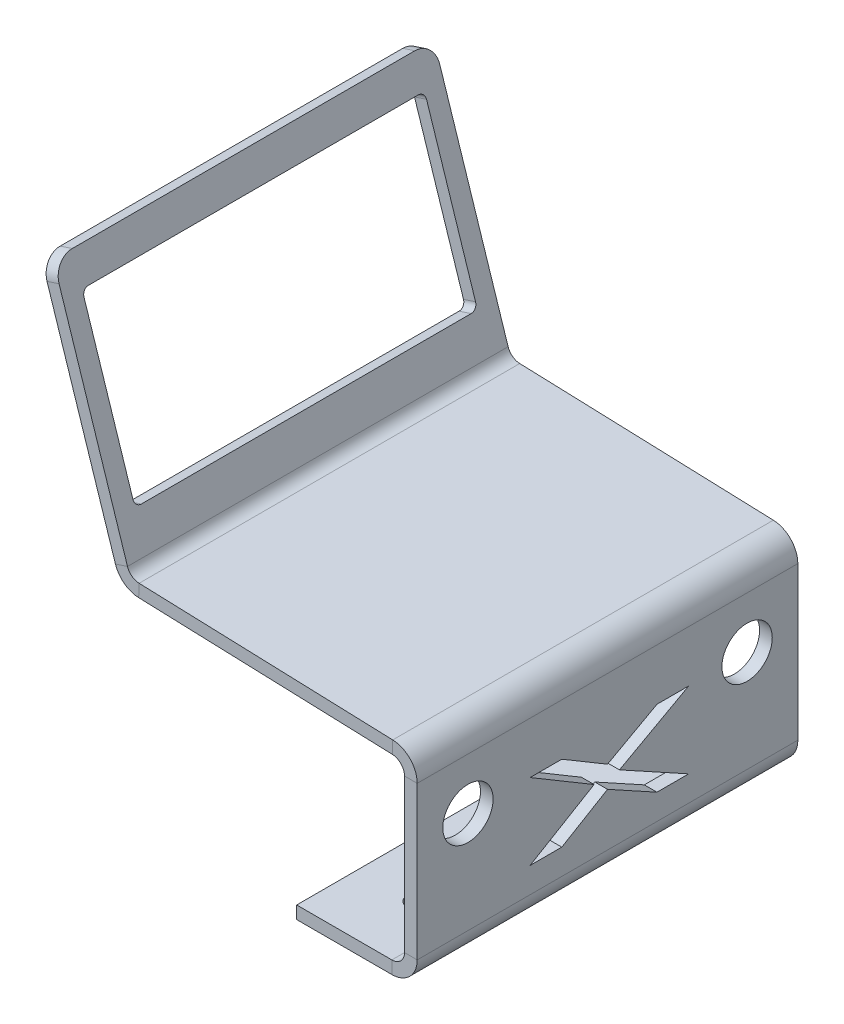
ISO-10303-21;
HEADER;
FILE_DESCRIPTION(('STEP AP214'),'2;1');
FILE_NAME('part.step','',(''),(''),'','','');
FILE_SCHEMA(('AUTOMOTIVE_DESIGN { 1 0 10303 214 1 1 1 1 }'));
ENDSEC;
DATA;
#1=APPLICATION_CONTEXT('core data for automotive mechanical design processes');
#2=APPLICATION_PROTOCOL_DEFINITION('international standard','automotive_design',2000,#1);
#3=PRODUCT_CONTEXT('',#1,'mechanical');
#4=PRODUCT('Part','Part','',(#3));
#5=PRODUCT_RELATED_PRODUCT_CATEGORY('part','',(#4));
#6=PRODUCT_DEFINITION_FORMATION('','',#4);
#7=PRODUCT_DEFINITION_CONTEXT('part definition',#1,'design');
#8=PRODUCT_DEFINITION('design','',#6,#7);
#9=PRODUCT_DEFINITION_SHAPE('','',#8);
#10=(LENGTH_UNIT() NAMED_UNIT(*) SI_UNIT(.MILLI.,.METRE.));
#11=(NAMED_UNIT(*) PLANE_ANGLE_UNIT() SI_UNIT($,.RADIAN.));
#12=(NAMED_UNIT(*) SI_UNIT($,.STERADIAN.) SOLID_ANGLE_UNIT());
#13=UNCERTAINTY_MEASURE_WITH_UNIT(LENGTH_MEASURE(1.E-05),#10,'distance_accuracy_value','');
#14=(GEOMETRIC_REPRESENTATION_CONTEXT(3) GLOBAL_UNCERTAINTY_ASSIGNED_CONTEXT((#13)) GLOBAL_UNIT_ASSIGNED_CONTEXT((#10,
#11,#12)) REPRESENTATION_CONTEXT('',''));
#15=CARTESIAN_POINT('',(0.,0.,0.));
#16=DIRECTION('',(0.,0.,1.));
#17=DIRECTION('',(1.,0.,0.));
#18=AXIS2_PLACEMENT_3D('',#15,#16,#17);
#19=CARTESIAN_POINT('',(-26.0215306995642,31.8794943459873,60.));
#20=DIRECTION('',(-0.951056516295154,-0.309016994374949,0.));
#21=DIRECTION('',(0.309016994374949,-0.951056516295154,0.));
#22=AXIS2_PLACEMENT_3D('',#19,#20,#21);
#23=PLANE('',#22);
#24=DIRECTION('',(-0.309016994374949,0.951056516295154,0.));
#25=VECTOR('',#24,1.);
#26=CARTESIAN_POINT('',(-26.0215306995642,31.8794943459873,0.));
#27=LINE('',#26,#25);
#28=CARTESIAN_POINT('',(-26.6706587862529,33.8773051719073,0.));
#29=VERTEX_POINT('',#28);
#30=CARTESIAN_POINT('',(-37.4551594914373,67.068585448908,0.));
#31=VERTEX_POINT('',#30);
#32=EDGE_CURVE('E530',#29,#31,#27,.T.);
#33=ORIENTED_EDGE('',*,*,#32,.T.);
#34=CARTESIAN_POINT('',(-37.4551594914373,67.068585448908,3.));
#35=DIRECTION('',(-0.951056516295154,-0.309016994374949,0.));
#36=DIRECTION('',(0.309016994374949,-0.951056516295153,0.));
#37=AXIS2_PLACEMENT_3D('',#34,#35,#36);
#38=CIRCLE('',#37,3.);
#39=CARTESIAN_POINT('',(-38.3822104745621,69.9217549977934,3.));
#40=VERTEX_POINT('',#39);
#41=EDGE_CURVE('E54',#31,#40,#38,.F.);
#42=ORIENTED_EDGE('',*,*,#41,.T.);
#43=DIRECTION('',(0.,0.,-1.));
#44=VECTOR('',#43,1.);
#45=CARTESIAN_POINT('',(-38.3822104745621,69.9217549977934,60.));
#46=LINE('',#45,#44);
#47=CARTESIAN_POINT('',(-38.3822104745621,69.9217549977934,57.));
#48=VERTEX_POINT('',#47);
#49=EDGE_CURVE('E532',#48,#40,#46,.T.);
#50=ORIENTED_EDGE('',*,*,#49,.F.);
#51=CARTESIAN_POINT('',(-37.4551594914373,67.068585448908,57.));
#52=DIRECTION('',(-0.951056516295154,-0.309016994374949,0.));
#53=DIRECTION('',(0.309016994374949,-0.951056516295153,0.));
#54=AXIS2_PLACEMENT_3D('',#51,#52,#53);
#55=CIRCLE('',#54,3.);
#56=CARTESIAN_POINT('',(-37.4551594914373,67.068585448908,60.));
#57=VERTEX_POINT('',#56);
#58=EDGE_CURVE('E61',#48,#57,#55,.F.);
#59=ORIENTED_EDGE('',*,*,#58,.T.);
#60=DIRECTION('',(0.309016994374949,-0.951056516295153,0.));
#61=VECTOR('',#60,1.);
#62=CARTESIAN_POINT('',(-26.0215306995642,31.8794943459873,60.));
#63=LINE('',#62,#61);
#64=CARTESIAN_POINT('',(-26.6706587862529,33.8773051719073,59.9999999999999));
#65=VERTEX_POINT('',#64);
#66=EDGE_CURVE('E544',#57,#65,#63,.T.);
#67=ORIENTED_EDGE('',*,*,#66,.T.);
#68=DIRECTION('',(0.,0.,-1.));
#69=VECTOR('',#68,1.);
#70=CARTESIAN_POINT('',(-26.6706587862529,33.8773051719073,0.));
#71=LINE('',#70,#69);
#72=EDGE_CURVE('E535',#65,#29,#71,.T.);
#73=ORIENTED_EDGE('',*,*,#72,.T.);
#74=EDGE_LOOP('',(#33,#42,#50,#59,#67,#73));
#75=FACE_BOUND('',#74,.T.);
#76=DIRECTION('',(0.309016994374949,-0.951056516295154,0.));
#77=VECTOR('',#76,1.);
#78=CARTESIAN_POINT('',(-26.0215306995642,31.8794943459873,57.));
#79=LINE('',#78,#77);
#80=CARTESIAN_POINT('',(-28.8026836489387,40.4390029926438,57.));
#81=VERTEX_POINT('',#80);
#82=CARTESIAN_POINT('',(-36.5281085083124,64.2154159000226,57.));
#83=VERTEX_POINT('',#82);
#84=EDGE_CURVE('E442',#81,#83,#79,.F.);
#85=ORIENTED_EDGE('',*,*,#84,.T.);
#86=CARTESIAN_POINT('',(-36.5281085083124,64.2154159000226,56.));
#87=DIRECTION('',(-0.951056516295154,-0.309016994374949,0.));
#88=DIRECTION('',(0.309016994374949,-0.951056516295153,0.));
#89=AXIS2_PLACEMENT_3D('',#86,#87,#88);
#90=CIRCLE('',#89,0.999999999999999);
#91=CARTESIAN_POINT('',(-36.8371255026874,65.1664724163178,56.));
#92=VERTEX_POINT('',#91);
#93=EDGE_CURVE('E439',#83,#92,#90,.T.);
#94=ORIENTED_EDGE('',*,*,#93,.T.);
#95=DIRECTION('',(0.,0.,1.));
#96=VECTOR('',#95,1.);
#97=CARTESIAN_POINT('',(-36.8371255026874,65.1664724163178,60.));
#98=LINE('',#97,#96);
#99=CARTESIAN_POINT('',(-36.8371255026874,65.1664724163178,3.99999999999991));
#100=VERTEX_POINT('',#99);
#101=EDGE_CURVE('E436',#92,#100,#98,.F.);
#102=ORIENTED_EDGE('',*,*,#101,.T.);
#103=CARTESIAN_POINT('',(-36.5281085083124,64.2154159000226,4.));
#104=DIRECTION('',(-0.951056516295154,-0.309016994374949,0.));
#105=DIRECTION('',(0.309016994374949,-0.951056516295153,0.));
#106=AXIS2_PLACEMENT_3D('',#103,#104,#105);
#107=CIRCLE('',#106,0.999999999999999);
#108=CARTESIAN_POINT('',(-36.5281085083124,64.2154159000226,2.99999999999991));
#109=VERTEX_POINT('',#108);
#110=EDGE_CURVE('E433',#100,#109,#107,.T.);
#111=ORIENTED_EDGE('',*,*,#110,.T.);
#112=DIRECTION('',(0.309016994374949,-0.951056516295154,0.));
#113=VECTOR('',#112,1.);
#114=CARTESIAN_POINT('',(-26.0215306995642,31.8794943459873,2.99999999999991));
#115=LINE('',#114,#113);
#116=CARTESIAN_POINT('',(-28.8026836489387,40.4390029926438,2.99999999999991));
#117=VERTEX_POINT('',#116);
#118=EDGE_CURVE('E430',#109,#117,#115,.T.);
#119=ORIENTED_EDGE('',*,*,#118,.T.);
#120=CARTESIAN_POINT('',(-28.8026836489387,40.4390029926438,4.));
#121=DIRECTION('',(-0.951056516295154,-0.309016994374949,0.));
#122=DIRECTION('',(0.309016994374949,-0.951056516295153,0.));
#123=AXIS2_PLACEMENT_3D('',#120,#121,#122);
#124=CIRCLE('',#123,1.);
#125=CARTESIAN_POINT('',(-28.4936666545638,39.4879464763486,3.99999999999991));
#126=VERTEX_POINT('',#125);
#127=EDGE_CURVE('E426',#117,#126,#124,.T.);
#128=ORIENTED_EDGE('',*,*,#127,.T.);
#129=DIRECTION('',(0.,0.,1.));
#130=VECTOR('',#129,1.);
#131=CARTESIAN_POINT('',(-28.4936666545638,39.4879464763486,60.));
#132=LINE('',#131,#130);
#133=CARTESIAN_POINT('',(-28.4936666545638,39.4879464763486,56.));
#134=VERTEX_POINT('',#133);
#135=EDGE_CURVE('E422',#126,#134,#132,.T.);
#136=ORIENTED_EDGE('',*,*,#135,.T.);
#137=CARTESIAN_POINT('',(-28.8026836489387,40.4390029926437,56.));
#138=DIRECTION('',(-0.951056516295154,-0.309016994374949,0.));
#139=DIRECTION('',(0.309016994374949,-0.951056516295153,0.));
#140=AXIS2_PLACEMENT_3D('',#137,#138,#139);
#141=CIRCLE('',#140,1.);
#142=EDGE_CURVE('E425',#134,#81,#141,.T.);
#143=ORIENTED_EDGE('',*,*,#142,.T.);
#144=EDGE_LOOP('',(#85,#94,#102,#111,#119,#128,#136,#143));
#145=FACE_BOUND('',#144,.T.);
#146=ADVANCED_FACE('F46',(#75,#145),#23,.F.);
#147=CARTESIAN_POINT('',(-27.9236437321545,31.2614603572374,60.));
#148=DIRECTION('',(-0.951056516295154,-0.309016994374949,0.));
#149=DIRECTION('',(0.309016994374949,-0.951056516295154,0.));
#150=AXIS2_PLACEMENT_3D('',#147,#148,#149);
#151=PLANE('',#150);
#152=DIRECTION('',(0.,0.,-1.));
#153=VECTOR('',#152,1.);
#154=CARTESIAN_POINT('',(-40.2843235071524,69.3037210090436,60.));
#155=LINE('',#154,#153);
#156=CARTESIAN_POINT('',(-40.2843235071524,69.3037210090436,57.));
#157=VERTEX_POINT('',#156);
#158=CARTESIAN_POINT('',(-40.2843235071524,69.3037210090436,3.));
#159=VERTEX_POINT('',#158);
#160=EDGE_CURVE('E525',#157,#159,#155,.T.);
#161=ORIENTED_EDGE('',*,*,#160,.T.);
#162=CARTESIAN_POINT('',(-39.3572725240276,66.4505514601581,3.));
#163=DIRECTION('',(-0.951056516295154,-0.309016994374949,0.));
#164=DIRECTION('',(0.309016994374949,-0.951056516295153,0.));
#165=AXIS2_PLACEMENT_3D('',#162,#163,#164);
#166=CIRCLE('',#165,3.);
#167=CARTESIAN_POINT('',(-39.3572725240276,66.4505514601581,0.));
#168=VERTEX_POINT('',#167);
#169=EDGE_CURVE('E630',#159,#168,#166,.T.);
#170=ORIENTED_EDGE('',*,*,#169,.T.);
#171=DIRECTION('',(-0.309016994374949,0.951056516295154,0.));
#172=VECTOR('',#171,1.);
#173=CARTESIAN_POINT('',(-27.9236437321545,31.2614603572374,0.));
#174=LINE('',#173,#172);
#175=CARTESIAN_POINT('',(-28.5727718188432,33.2592711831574,0.));
#176=VERTEX_POINT('',#175);
#177=EDGE_CURVE('E523',#176,#168,#174,.T.);
#178=ORIENTED_EDGE('',*,*,#177,.F.);
#179=DIRECTION('',(0.,0.,-1.));
#180=VECTOR('',#179,1.);
#181=CARTESIAN_POINT('',(-28.5727718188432,33.2592711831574,0.));
#182=LINE('',#181,#180);
#183=CARTESIAN_POINT('',(-28.5727718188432,33.2592711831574,59.9999999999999));
#184=VERTEX_POINT('',#183);
#185=EDGE_CURVE('E528',#184,#176,#182,.T.);
#186=ORIENTED_EDGE('',*,*,#185,.F.);
#187=DIRECTION('',(0.309016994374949,-0.951056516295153,0.));
#188=VECTOR('',#187,1.);
#189=CARTESIAN_POINT('',(-27.9236437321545,31.2614603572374,60.));
#190=LINE('',#189,#188);
#191=CARTESIAN_POINT('',(-39.3572725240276,66.4505514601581,60.));
#192=VERTEX_POINT('',#191);
#193=EDGE_CURVE('E546',#192,#184,#190,.T.);
#194=ORIENTED_EDGE('',*,*,#193,.F.);
#195=CARTESIAN_POINT('',(-39.3572725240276,66.4505514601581,57.));
#196=DIRECTION('',(-0.951056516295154,-0.309016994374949,0.));
#197=DIRECTION('',(0.309016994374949,-0.951056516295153,0.));
#198=AXIS2_PLACEMENT_3D('',#195,#196,#197);
#199=CIRCLE('',#198,3.);
#200=EDGE_CURVE('E628',#192,#157,#199,.T.);
#201=ORIENTED_EDGE('',*,*,#200,.T.);
#202=EDGE_LOOP('',(#161,#170,#178,#186,#194,#201));
#203=FACE_BOUND('',#202,.T.);
#204=CARTESIAN_POINT('',(-38.4302215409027,63.5973819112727,56.));
#205=DIRECTION('',(-0.951056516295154,-0.309016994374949,0.));
#206=DIRECTION('',(0.309016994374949,-0.951056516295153,0.));
#207=AXIS2_PLACEMENT_3D('',#204,#205,#206);
#208=CIRCLE('',#207,0.999999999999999);
#209=CARTESIAN_POINT('',(-38.4302215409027,63.5973819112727,57.));
#210=VERTEX_POINT('',#209);
#211=CARTESIAN_POINT('',(-38.7392385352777,64.5484384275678,56.));
#212=VERTEX_POINT('',#211);
#213=EDGE_CURVE('E412',#210,#212,#208,.T.);
#214=ORIENTED_EDGE('',*,*,#213,.F.);
#215=DIRECTION('',(-0.309016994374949,0.951056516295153,0.));
#216=VECTOR('',#215,1.);
#217=CARTESIAN_POINT('',(-27.9236437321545,31.2614603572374,57.));
#218=LINE('',#217,#216);
#219=CARTESIAN_POINT('',(-30.704796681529,39.8209690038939,57.));
#220=VERTEX_POINT('',#219);
#221=EDGE_CURVE('E410',#220,#210,#218,.T.);
#222=ORIENTED_EDGE('',*,*,#221,.F.);
#223=CARTESIAN_POINT('',(-30.704796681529,39.8209690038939,56.));
#224=DIRECTION('',(-0.951056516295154,-0.309016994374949,0.));
#225=DIRECTION('',(0.309016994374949,-0.951056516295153,0.));
#226=AXIS2_PLACEMENT_3D('',#223,#224,#225);
#227=CIRCLE('',#226,1.);
#228=CARTESIAN_POINT('',(-30.3957796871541,38.8699124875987,56.));
#229=VERTEX_POINT('',#228);
#230=EDGE_CURVE('E408',#229,#220,#227,.T.);
#231=ORIENTED_EDGE('',*,*,#230,.F.);
#232=DIRECTION('',(0.,0.,1.));
#233=VECTOR('',#232,1.);
#234=CARTESIAN_POINT('',(-30.3957796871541,38.8699124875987,60.));
#235=LINE('',#234,#233);
#236=CARTESIAN_POINT('',(-30.3957796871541,38.8699124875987,4.));
#237=VERTEX_POINT('',#236);
#238=EDGE_CURVE('E405',#237,#229,#235,.T.);
#239=ORIENTED_EDGE('',*,*,#238,.F.);
#240=CARTESIAN_POINT('',(-30.704796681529,39.8209690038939,4.));
#241=DIRECTION('',(-0.951056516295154,-0.309016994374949,0.));
#242=DIRECTION('',(0.309016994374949,-0.951056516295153,0.));
#243=AXIS2_PLACEMENT_3D('',#240,#241,#242);
#244=CIRCLE('',#243,1.);
#245=CARTESIAN_POINT('',(-30.704796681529,39.8209690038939,3.));
#246=VERTEX_POINT('',#245);
#247=EDGE_CURVE('E420',#246,#237,#244,.T.);
#248=ORIENTED_EDGE('',*,*,#247,.F.);
#249=DIRECTION('',(0.309016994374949,-0.951056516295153,0.));
#250=VECTOR('',#249,1.);
#251=CARTESIAN_POINT('',(-27.9236437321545,31.2614603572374,3.));
#252=LINE('',#251,#250);
#253=CARTESIAN_POINT('',(-38.4302215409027,63.5973819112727,3.));
#254=VERTEX_POINT('',#253);
#255=EDGE_CURVE('E418',#254,#246,#252,.T.);
#256=ORIENTED_EDGE('',*,*,#255,.F.);
#257=CARTESIAN_POINT('',(-38.4302215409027,63.5973819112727,4.));
#258=DIRECTION('',(-0.951056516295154,-0.309016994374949,0.));
#259=DIRECTION('',(0.309016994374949,-0.951056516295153,0.));
#260=AXIS2_PLACEMENT_3D('',#257,#258,#259);
#261=CIRCLE('',#260,0.999999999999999);
#262=CARTESIAN_POINT('',(-38.7392385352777,64.5484384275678,4.));
#263=VERTEX_POINT('',#262);
#264=EDGE_CURVE('E416',#263,#254,#261,.T.);
#265=ORIENTED_EDGE('',*,*,#264,.F.);
#266=DIRECTION('',(0.,0.,-1.));
#267=VECTOR('',#266,1.);
#268=CARTESIAN_POINT('',(-38.7392385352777,64.5484384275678,60.));
#269=LINE('',#268,#267);
#270=EDGE_CURVE('E414',#212,#263,#269,.T.);
#271=ORIENTED_EDGE('',*,*,#270,.F.);
#272=EDGE_LOOP('',(#214,#222,#231,#239,#248,#256,#265,#271));
#273=FACE_BOUND('',#272,.T.);
#274=ADVANCED_FACE('F644',(#203,#273),#151,.T.);
#275=CARTESIAN_POINT('',(0.,122.69316876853,0.));
#276=DIRECTION('',(0.,0.,-1.));
#277=DIRECTION('',(0.999390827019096,0.0348994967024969,0.));
#278=AXIS2_PLACEMENT_3D('',#275,#276,#277);
#279=PLANE('',#278);
#280=DIRECTION('',(1.,0.,0.));
#281=VECTOR('',#280,1.);
#282=CARTESIAN_POINT('',(0.,-0.999999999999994,0.));
#283=LINE('',#282,#281);
#284=CARTESIAN_POINT('',(0.,-0.999999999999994,0.));
#285=VERTEX_POINT('',#284);
#286=CARTESIAN_POINT('',(15.,-0.999999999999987,0.));
#287=VERTEX_POINT('',#286);
#288=EDGE_CURVE('E591',#285,#287,#283,.T.);
#289=ORIENTED_EDGE('',*,*,#288,.F.);
#290=DIRECTION('',(0.,-1.,0.));
#291=VECTOR('',#290,1.);
#292=CARTESIAN_POINT('',(0.,122.69316876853,0.));
#293=LINE('',#292,#291);
#294=CARTESIAN_POINT('',(0.,0.999999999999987,0.));
#295=VERTEX_POINT('',#294);
#296=EDGE_CURVE('E617',#295,#285,#293,.T.);
#297=ORIENTED_EDGE('',*,*,#296,.F.);
#298=DIRECTION('',(1.,0.,0.));
#299=VECTOR('',#298,1.);
#300=CARTESIAN_POINT('',(0.,1.00000000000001,0.));
#301=LINE('',#300,#299);
#302=CARTESIAN_POINT('',(15.,1.00000000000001,0.));
#303=VERTEX_POINT('',#302);
#304=EDGE_CURVE('E602',#295,#303,#301,.T.);
#305=ORIENTED_EDGE('',*,*,#304,.T.);
#306=DIRECTION('',(0.,-1.,0.));
#307=VECTOR('',#306,1.);
#308=CARTESIAN_POINT('',(15.,122.69316876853,0.));
#309=LINE('',#308,#307);
#310=EDGE_CURVE('E620',#303,#287,#309,.T.);
#311=ORIENTED_EDGE('',*,*,#310,.T.);
#312=EDGE_LOOP('',(#289,#297,#305,#311));
#313=FACE_BOUND('',#312,.T.);
#314=ADVANCED_FACE('F48',(#313),#279,.T.);
#315=CARTESIAN_POINT('',(0.,122.69316876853,60.));
#316=DIRECTION('',(-1.,0.,0.));
#317=DIRECTION('',(0.,-1.,0.));
#318=AXIS2_PLACEMENT_3D('',#315,#316,#317);
#319=PLANE('',#318);
#320=DIRECTION('',(0.,0.,-1.));
#321=VECTOR('',#320,1.);
#322=CARTESIAN_POINT('',(0.,-0.999999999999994,60.));
#323=LINE('',#322,#321);
#324=CARTESIAN_POINT('',(0.,-0.999999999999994,60.));
#325=VERTEX_POINT('',#324);
#326=EDGE_CURVE('E597',#325,#285,#323,.T.);
#327=ORIENTED_EDGE('',*,*,#326,.F.);
#328=DIRECTION('',(0.,-1.,0.));
#329=VECTOR('',#328,1.);
#330=CARTESIAN_POINT('',(0.,122.69316876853,60.));
#331=LINE('',#330,#329);
#332=CARTESIAN_POINT('',(0.,1.,60.));
#333=VERTEX_POINT('',#332);
#334=EDGE_CURVE('E614',#333,#325,#331,.T.);
#335=ORIENTED_EDGE('',*,*,#334,.F.);
#336=DIRECTION('',(0.,0.,-1.));
#337=VECTOR('',#336,1.);
#338=CARTESIAN_POINT('',(0.,1.00000000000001,60.));
#339=LINE('',#338,#337);
#340=EDGE_CURVE('E605',#333,#295,#339,.T.);
#341=ORIENTED_EDGE('',*,*,#340,.T.);
#342=ORIENTED_EDGE('',*,*,#296,.T.);
#343=EDGE_LOOP('',(#327,#335,#341,#342));
#344=FACE_BOUND('',#343,.T.);
#345=ADVANCED_FACE('F742',(#344),#319,.T.);
#346=CARTESIAN_POINT('',(0.,122.69316876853,60.));
#347=DIRECTION('',(0.,0.,-1.));
#348=DIRECTION('',(0.999390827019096,0.0348994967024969,0.));
#349=AXIS2_PLACEMENT_3D('',#346,#347,#348);
#350=PLANE('',#349);
#351=ORIENTED_EDGE('',*,*,#334,.T.);
#352=DIRECTION('',(1.,0.,0.));
#353=VECTOR('',#352,1.);
#354=CARTESIAN_POINT('',(0.,-0.999999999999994,60.));
#355=LINE('',#354,#353);
#356=CARTESIAN_POINT('',(15.,-0.999999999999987,59.9999999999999));
#357=VERTEX_POINT('',#356);
#358=EDGE_CURVE('E594',#325,#357,#355,.T.);
#359=ORIENTED_EDGE('',*,*,#358,.T.);
#360=DIRECTION('',(0.,-1.,0.));
#361=VECTOR('',#360,1.);
#362=CARTESIAN_POINT('',(15.,122.69316876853,60.));
#363=LINE('',#362,#361);
#364=CARTESIAN_POINT('',(15.,1.00000000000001,59.9999999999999));
#365=VERTEX_POINT('',#364);
#366=EDGE_CURVE('E612',#365,#357,#363,.T.);
#367=ORIENTED_EDGE('',*,*,#366,.F.);
#368=DIRECTION('',(1.,0.,0.));
#369=VECTOR('',#368,1.);
#370=CARTESIAN_POINT('',(0.,1.00000000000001,60.));
#371=LINE('',#370,#369);
#372=EDGE_CURVE('E607',#333,#365,#371,.T.);
#373=ORIENTED_EDGE('',*,*,#372,.F.);
#374=EDGE_LOOP('',(#351,#359,#367,#373));
#375=FACE_BOUND('',#374,.T.);
#376=ADVANCED_FACE('F739',(#375),#350,.F.);
#377=CARTESIAN_POINT('',(0.,1.00000000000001,60.));
#378=DIRECTION('',(0.,1.,0.));
#379=DIRECTION('',(0.,0.,1.));
#380=AXIS2_PLACEMENT_3D('',#377,#378,#379);
#381=PLANE('',#380);
#382=CARTESIAN_POINT('',(9.00000000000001,1.00000000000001,9.99999999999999));
#383=DIRECTION('',(0.,1.,0.));
#384=DIRECTION('',(0.,0.,1.));
#385=AXIS2_PLACEMENT_3D('',#382,#383,#384);
#386=CIRCLE('',#385,1.6);
#387=CARTESIAN_POINT('',(9.00000000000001,1.00000000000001,11.6));
#388=VERTEX_POINT('',#387);
#389=EDGE_CURVE('E913',#388,#388,#386,.T.);
#390=ORIENTED_EDGE('',*,*,#389,.F.);
#391=EDGE_LOOP('',(#390));
#392=FACE_BOUND('',#391,.T.);
#393=CARTESIAN_POINT('',(9.,1.00000000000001,50.));
#394=DIRECTION('',(0.,1.,0.));
#395=DIRECTION('',(0.,0.,1.));
#396=AXIS2_PLACEMENT_3D('',#393,#394,#395);
#397=CIRCLE('',#396,1.6);
#398=CARTESIAN_POINT('',(9.,1.00000000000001,51.6));
#399=VERTEX_POINT('',#398);
#400=EDGE_CURVE('E923',#399,#399,#397,.T.);
#401=ORIENTED_EDGE('',*,*,#400,.F.);
#402=EDGE_LOOP('',(#401));
#403=FACE_BOUND('',#402,.T.);
#404=DIRECTION('',(0.,0.,1.));
#405=VECTOR('',#404,1.);
#406=CARTESIAN_POINT('',(15.,1.00000000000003,0.));
#407=LINE('',#406,#405);
#408=EDGE_CURVE('E610',#303,#365,#407,.T.);
#409=ORIENTED_EDGE('',*,*,#408,.F.);
#410=ORIENTED_EDGE('',*,*,#304,.F.);
#411=ORIENTED_EDGE('',*,*,#340,.F.);
#412=ORIENTED_EDGE('',*,*,#372,.T.);
#413=EDGE_LOOP('',(#409,#410,#411,#412));
#414=FACE_BOUND('',#413,.T.);
#415=ADVANCED_FACE('F735',(#392,#403,#414),#381,.T.);
#416=CARTESIAN_POINT('',(0.,-0.999999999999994,60.));
#417=DIRECTION('',(0.,1.,0.));
#418=DIRECTION('',(0.,0.,1.));
#419=AXIS2_PLACEMENT_3D('',#416,#417,#418);
#420=PLANE('',#419);
#421=CARTESIAN_POINT('',(9.00000000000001,-0.999999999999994,9.99999999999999));
#422=DIRECTION('',(0.,-1.,0.));
#423=DIRECTION('',(1.,0.,0.));
#424=AXIS2_PLACEMENT_3D('',#421,#422,#423);
#425=CIRCLE('',#424,1.6);
#426=CARTESIAN_POINT('',(10.6,-0.999999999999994,9.99999999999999));
#427=VERTEX_POINT('',#426);
#428=EDGE_CURVE('E916',#427,#427,#425,.T.);
#429=ORIENTED_EDGE('',*,*,#428,.F.);
#430=EDGE_LOOP('',(#429));
#431=FACE_BOUND('',#430,.T.);
#432=CARTESIAN_POINT('',(9.,-0.999999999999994,50.));
#433=DIRECTION('',(0.,-1.,0.));
#434=DIRECTION('',(1.,0.,0.));
#435=AXIS2_PLACEMENT_3D('',#432,#433,#434);
#436=CIRCLE('',#435,1.6);
#437=CARTESIAN_POINT('',(10.6,-0.999999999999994,50.));
#438=VERTEX_POINT('',#437);
#439=EDGE_CURVE('E918',#438,#438,#436,.T.);
#440=ORIENTED_EDGE('',*,*,#439,.F.);
#441=EDGE_LOOP('',(#440));
#442=FACE_BOUND('',#441,.T.);
#443=ORIENTED_EDGE('',*,*,#288,.T.);
#444=DIRECTION('',(0.,0.,1.));
#445=VECTOR('',#444,1.);
#446=CARTESIAN_POINT('',(15.,-0.99999999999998,0.));
#447=LINE('',#446,#445);
#448=EDGE_CURVE('E599',#287,#357,#447,.T.);
#449=ORIENTED_EDGE('',*,*,#448,.T.);
#450=ORIENTED_EDGE('',*,*,#358,.F.);
#451=ORIENTED_EDGE('',*,*,#326,.T.);
#452=EDGE_LOOP('',(#443,#449,#450,#451));
#453=FACE_BOUND('',#452,.T.);
#454=ADVANCED_FACE('F731',(#431,#442,#453),#420,.F.);
#455=CARTESIAN_POINT('',(-110.320553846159,0.,0.));
#456=DIRECTION('',(0.,0.,-1.));
#457=DIRECTION('',(-0.0348994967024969,0.999390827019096,0.));
#458=AXIS2_PLACEMENT_3D('',#455,#456,#457);
#459=PLANE('',#458);
#460=DIRECTION('',(0.,1.,0.));
#461=VECTOR('',#460,1.);
#462=CARTESIAN_POINT('',(19.,0.,0.));
#463=LINE('',#462,#461);
#464=CARTESIAN_POINT('',(19.,3.00000000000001,0.));
#465=VERTEX_POINT('',#464);
#466=CARTESIAN_POINT('',(19.,27.1029336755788,0.));
#467=VERTEX_POINT('',#466);
#468=EDGE_CURVE('E559',#465,#467,#463,.T.);
#469=ORIENTED_EDGE('',*,*,#468,.F.);
#470=DIRECTION('',(1.,0.,0.));
#471=VECTOR('',#470,1.);
#472=CARTESIAN_POINT('',(-110.320553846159,3.,0.));
#473=LINE('',#472,#471);
#474=CARTESIAN_POINT('',(17.,3.,0.));
#475=VERTEX_POINT('',#474);
#476=EDGE_CURVE('E584',#475,#465,#473,.T.);
#477=ORIENTED_EDGE('',*,*,#476,.F.);
#478=DIRECTION('',(0.,1.,0.));
#479=VECTOR('',#478,1.);
#480=CARTESIAN_POINT('',(17.,0.,0.));
#481=LINE('',#480,#479);
#482=CARTESIAN_POINT('',(17.,27.1029336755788,0.));
#483=VERTEX_POINT('',#482);
#484=EDGE_CURVE('E567',#475,#483,#481,.T.);
#485=ORIENTED_EDGE('',*,*,#484,.T.);
#486=DIRECTION('',(1.,0.,0.));
#487=VECTOR('',#486,1.);
#488=CARTESIAN_POINT('',(-110.320553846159,27.1029336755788,0.));
#489=LINE('',#488,#487);
#490=EDGE_CURVE('E576',#483,#467,#489,.T.);
#491=ORIENTED_EDGE('',*,*,#490,.T.);
#492=EDGE_LOOP('',(#469,#477,#485,#491));
#493=FACE_BOUND('',#492,.T.);
#494=ADVANCED_FACE('F727',(#493),#459,.T.);
#495=CARTESIAN_POINT('',(-110.320553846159,0.,60.));
#496=DIRECTION('',(0.,0.,-1.));
#497=DIRECTION('',(-0.0348994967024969,0.999390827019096,0.));
#498=AXIS2_PLACEMENT_3D('',#495,#496,#497);
#499=PLANE('',#498);
#500=DIRECTION('',(1.,0.,0.));
#501=VECTOR('',#500,1.);
#502=CARTESIAN_POINT('',(-110.320553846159,3.,60.));
#503=LINE('',#502,#501);
#504=CARTESIAN_POINT('',(17.,2.99999999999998,59.9999999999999));
#505=VERTEX_POINT('',#504);
#506=CARTESIAN_POINT('',(19.,3.,60.));
#507=VERTEX_POINT('',#506);
#508=EDGE_CURVE('E581',#505,#507,#503,.T.);
#509=ORIENTED_EDGE('',*,*,#508,.T.);
#510=DIRECTION('',(0.,1.,0.));
#511=VECTOR('',#510,1.);
#512=CARTESIAN_POINT('',(19.,0.,60.));
#513=LINE('',#512,#511);
#514=CARTESIAN_POINT('',(19.,27.1029336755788,60.));
#515=VERTEX_POINT('',#514);
#516=EDGE_CURVE('E562',#507,#515,#513,.T.);
#517=ORIENTED_EDGE('',*,*,#516,.T.);
#518=DIRECTION('',(1.,0.,0.));
#519=VECTOR('',#518,1.);
#520=CARTESIAN_POINT('',(-110.320553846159,27.1029336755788,60.));
#521=LINE('',#520,#519);
#522=CARTESIAN_POINT('',(17.,27.1029336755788,60.));
#523=VERTEX_POINT('',#522);
#524=EDGE_CURVE('E579',#523,#515,#521,.T.);
#525=ORIENTED_EDGE('',*,*,#524,.F.);
#526=DIRECTION('',(0.,1.,0.));
#527=VECTOR('',#526,1.);
#528=CARTESIAN_POINT('',(17.,0.,60.));
#529=LINE('',#528,#527);
#530=EDGE_CURVE('E570',#505,#523,#529,.T.);
#531=ORIENTED_EDGE('',*,*,#530,.F.);
#532=EDGE_LOOP('',(#509,#517,#525,#531));
#533=FACE_BOUND('',#532,.T.);
#534=ADVANCED_FACE('F723',(#533),#499,.F.);
#535=CARTESIAN_POINT('',(17.,0.,60.));
#536=DIRECTION('',(-1.,0.,0.));
#537=DIRECTION('',(0.,0.,1.));
#538=AXIS2_PLACEMENT_3D('',#535,#536,#537);
#539=PLANE('',#538);
#540=DIRECTION('',(0.,0.481878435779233,0.876238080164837));
#541=VECTOR('',#540,1.);
#542=CARTESIAN_POINT('',(17.,21.3323014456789,48.2685125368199));
#543=LINE('',#542,#541);
#544=CARTESIAN_POINT('',(17.,7.,22.2069431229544));
#545=VERTEX_POINT('',#544);
#546=CARTESIAN_POINT('',(17.,11.2857142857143,30.));
#547=VERTEX_POINT('',#546);
#548=EDGE_CURVE('E391',#545,#547,#543,.T.);
#549=ORIENTED_EDGE('',*,*,#548,.F.);
#550=DIRECTION('',(0.,0.,1.));
#551=VECTOR('',#550,1.);
#552=CARTESIAN_POINT('',(17.,7.,60.));
#553=LINE('',#552,#551);
#554=CARTESIAN_POINT('',(17.,7.,17.2069431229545));
#555=VERTEX_POINT('',#554);
#556=EDGE_CURVE('E352',#555,#545,#553,.T.);
#557=ORIENTED_EDGE('',*,*,#556,.F.);
#558=DIRECTION('',(0.,-0.481878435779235,-0.876238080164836));
#559=VECTOR('',#558,1.);
#560=CARTESIAN_POINT('',(17.,23.4435026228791,47.1074784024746));
#561=LINE('',#560,#559);
#562=CARTESIAN_POINT('',(17.,13.,28.1172227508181));
#563=VERTEX_POINT('',#562);
#564=EDGE_CURVE('E302',#563,#555,#561,.T.);
#565=ORIENTED_EDGE('',*,*,#564,.F.);
#566=DIRECTION('',(0.,-0.481878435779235,0.876238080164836));
#567=VECTOR('',#566,1.);
#568=CARTESIAN_POINT('',(17.,-3.48088012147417,58.0857245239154));
#569=LINE('',#568,#567);
#570=CARTESIAN_POINT('',(17.,19.,17.2069431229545));
#571=VERTEX_POINT('',#570);
#572=EDGE_CURVE('E373',#571,#563,#569,.T.);
#573=ORIENTED_EDGE('',*,*,#572,.F.);
#574=DIRECTION('',(0.,0.,-1.));
#575=VECTOR('',#574,1.);
#576=CARTESIAN_POINT('',(17.,19.,60.));
#577=LINE('',#576,#575);
#578=CARTESIAN_POINT('',(17.,19.,22.2069431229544));
#579=VERTEX_POINT('',#578);
#580=EDGE_CURVE('E375',#579,#571,#577,.T.);
#581=ORIENTED_EDGE('',*,*,#580,.F.);
#582=DIRECTION('',(0.,0.481878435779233,-0.876238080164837));
#583=VECTOR('',#582,1.);
#584=CARTESIAN_POINT('',(17.,-1.36967894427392,59.2467586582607));
#585=LINE('',#584,#583);
#586=CARTESIAN_POINT('',(17.,14.7142857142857,30.));
#587=VERTEX_POINT('',#586);
#588=EDGE_CURVE('E377',#587,#579,#585,.T.);
#589=ORIENTED_EDGE('',*,*,#588,.F.);
#590=DIRECTION('',(0.,-0.511119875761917,-0.859509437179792));
#591=VECTOR('',#590,1.);
#592=CARTESIAN_POINT('',(17.,24.0496445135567,45.6985266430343));
#593=LINE('',#592,#591);
#594=CARTESIAN_POINT('',(17.,19.,37.2069431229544));
#595=VERTEX_POINT('',#594);
#596=EDGE_CURVE('E379',#595,#587,#593,.T.);
#597=ORIENTED_EDGE('',*,*,#596,.F.);
#598=DIRECTION('',(0.,0.,-1.));
#599=VECTOR('',#598,1.);
#600=CARTESIAN_POINT('',(17.,19.,60.));
#601=LINE('',#600,#599);
#602=CARTESIAN_POINT('',(17.,19.,42.2069431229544));
#603=VERTEX_POINT('',#602);
#604=EDGE_CURVE('E381',#603,#595,#601,.T.);
#605=ORIENTED_EDGE('',*,*,#604,.F.);
#606=DIRECTION('',(0.,0.511119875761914,0.859509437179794));
#607=VECTOR('',#606,1.);
#608=CARTESIAN_POINT('',(17.,21.8530827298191,47.0047442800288));
#609=LINE('',#608,#607);
#610=CARTESIAN_POINT('',(17.,13.,32.1172227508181));
#611=VERTEX_POINT('',#610);
#612=EDGE_CURVE('E383',#611,#603,#609,.T.);
#613=ORIENTED_EDGE('',*,*,#612,.F.);
#614=DIRECTION('',(0.,0.511119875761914,-0.859509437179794));
#615=VECTOR('',#614,1.);
#616=CARTESIAN_POINT('',(17.,-2.64541444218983,58.4268655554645));
#617=LINE('',#616,#615);
#618=CARTESIAN_POINT('',(17.,7.,42.2069431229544));
#619=VERTEX_POINT('',#618);
#620=EDGE_CURVE('E385',#619,#611,#617,.T.);
#621=ORIENTED_EDGE('',*,*,#620,.F.);
#622=DIRECTION('',(0.,0.,1.));
#623=VECTOR('',#622,1.);
#624=CARTESIAN_POINT('',(17.,7.,60.));
#625=LINE('',#624,#623);
#626=CARTESIAN_POINT('',(17.,7.,37.2069431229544));
#627=VERTEX_POINT('',#626);
#628=EDGE_CURVE('E387',#627,#619,#625,.T.);
#629=ORIENTED_EDGE('',*,*,#628,.F.);
#630=DIRECTION('',(0.,-0.511119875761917,0.859509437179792));
#631=VECTOR('',#630,1.);
#632=CARTESIAN_POINT('',(17.,-4.84197622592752,57.1206479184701));
#633=LINE('',#632,#631);
#634=EDGE_CURVE('E389',#547,#627,#633,.T.);
#635=ORIENTED_EDGE('',*,*,#634,.F.);
#636=EDGE_LOOP('',(#549,#557,#565,#573,#581,#589,#597,#605,#613,#621,#629,#635));
#637=FACE_BOUND('',#636,.T.);
#638=CARTESIAN_POINT('',(17.,19.,8.));
#639=DIRECTION('',(-1.,0.,0.));
#640=DIRECTION('',(0.,0.,1.));
#641=AXIS2_PLACEMENT_3D('',#638,#639,#640);
#642=CIRCLE('',#641,3.968937);
#643=CARTESIAN_POINT('',(17.,19.,11.968937));
#644=VERTEX_POINT('',#643);
#645=EDGE_CURVE('E396',#644,#644,#642,.T.);
#646=ORIENTED_EDGE('',*,*,#645,.F.);
#647=EDGE_LOOP('',(#646));
#648=FACE_BOUND('',#647,.T.);
#649=CARTESIAN_POINT('',(17.,19.,52.));
#650=DIRECTION('',(-1.,0.,0.));
#651=DIRECTION('',(0.,0.,1.));
#652=AXIS2_PLACEMENT_3D('',#649,#650,#651);
#653=CIRCLE('',#652,3.968937);
#654=CARTESIAN_POINT('',(17.,19.,55.968937));
#655=VERTEX_POINT('',#654);
#656=EDGE_CURVE('E402',#655,#655,#653,.T.);
#657=ORIENTED_EDGE('',*,*,#656,.F.);
#658=EDGE_LOOP('',(#657));
#659=FACE_BOUND('',#658,.T.);
#660=ORIENTED_EDGE('',*,*,#484,.F.);
#661=DIRECTION('',(0.,0.,1.));
#662=VECTOR('',#661,1.);
#663=CARTESIAN_POINT('',(17.,3.,0.));
#664=LINE('',#663,#662);
#665=EDGE_CURVE('E573',#475,#505,#664,.T.);
#666=ORIENTED_EDGE('',*,*,#665,.T.);
#667=ORIENTED_EDGE('',*,*,#530,.T.);
#668=DIRECTION('',(0.,0.,1.));
#669=VECTOR('',#668,1.);
#670=CARTESIAN_POINT('',(17.,27.1029336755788,0.));
#671=LINE('',#670,#669);
#672=EDGE_CURVE('E586',#483,#523,#671,.T.);
#673=ORIENTED_EDGE('',*,*,#672,.F.);
#674=EDGE_LOOP('',(#660,#666,#667,#673));
#675=FACE_BOUND('',#674,.T.);
#676=ADVANCED_FACE('F720',(#637,#648,#659,#675),#539,.T.);
#677=CARTESIAN_POINT('',(19.,0.,60.));
#678=DIRECTION('',(-1.,0.,0.));
#679=DIRECTION('',(0.,0.,1.));
#680=AXIS2_PLACEMENT_3D('',#677,#678,#679);
#681=PLANE('',#680);
#682=DIRECTION('',(0.,0.,-1.));
#683=VECTOR('',#682,1.);
#684=CARTESIAN_POINT('',(19.,7.,22.2069431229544));
#685=LINE('',#684,#683);
#686=CARTESIAN_POINT('',(19.,7.,22.2069431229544));
#687=VERTEX_POINT('',#686);
#688=CARTESIAN_POINT('',(19.,7.,17.2069431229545));
#689=VERTEX_POINT('',#688);
#690=EDGE_CURVE('E310',#687,#689,#685,.T.);
#691=ORIENTED_EDGE('',*,*,#690,.F.);
#692=DIRECTION('',(0.,-0.481878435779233,-0.876238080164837));
#693=VECTOR('',#692,1.);
#694=CARTESIAN_POINT('',(19.,7.,22.2069431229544));
#695=LINE('',#694,#693);
#696=CARTESIAN_POINT('',(19.,11.2857142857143,30.));
#697=VERTEX_POINT('',#696);
#698=EDGE_CURVE('E315',#697,#687,#695,.T.);
#699=ORIENTED_EDGE('',*,*,#698,.F.);
#700=DIRECTION('',(0.,0.511119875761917,-0.859509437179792));
#701=VECTOR('',#700,1.);
#702=CARTESIAN_POINT('',(19.,11.2857142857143,30.));
#703=LINE('',#702,#701);
#704=CARTESIAN_POINT('',(19.,7.,37.2069431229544));
#705=VERTEX_POINT('',#704);
#706=EDGE_CURVE('E347',#705,#697,#703,.T.);
#707=ORIENTED_EDGE('',*,*,#706,.F.);
#708=DIRECTION('',(0.,0.,-1.));
#709=VECTOR('',#708,1.);
#710=CARTESIAN_POINT('',(19.,7.,37.2069431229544));
#711=LINE('',#710,#709);
#712=CARTESIAN_POINT('',(19.,7.,42.2069431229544));
#713=VERTEX_POINT('',#712);
#714=EDGE_CURVE('E344',#713,#705,#711,.T.);
#715=ORIENTED_EDGE('',*,*,#714,.F.);
#716=DIRECTION('',(0.,-0.511119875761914,0.859509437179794));
#717=VECTOR('',#716,1.);
#718=CARTESIAN_POINT('',(19.,7.,42.2069431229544));
#719=LINE('',#718,#717);
#720=CARTESIAN_POINT('',(19.,13.,32.1172227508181));
#721=VERTEX_POINT('',#720);
#722=EDGE_CURVE('E341',#721,#713,#719,.T.);
#723=ORIENTED_EDGE('',*,*,#722,.F.);
#724=DIRECTION('',(0.,-0.511119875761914,-0.859509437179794));
#725=VECTOR('',#724,1.);
#726=CARTESIAN_POINT('',(19.,13.,32.1172227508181));
#727=LINE('',#726,#725);
#728=CARTESIAN_POINT('',(19.,19.,42.2069431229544));
#729=VERTEX_POINT('',#728);
#730=EDGE_CURVE('E338',#729,#721,#727,.T.);
#731=ORIENTED_EDGE('',*,*,#730,.F.);
#732=DIRECTION('',(0.,0.,1.));
#733=VECTOR('',#732,1.);
#734=CARTESIAN_POINT('',(19.,19.,42.2069431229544));
#735=LINE('',#734,#733);
#736=CARTESIAN_POINT('',(19.,19.,37.2069431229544));
#737=VERTEX_POINT('',#736);
#738=EDGE_CURVE('E335',#737,#729,#735,.T.);
#739=ORIENTED_EDGE('',*,*,#738,.F.);
#740=DIRECTION('',(0.,0.511119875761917,0.859509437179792));
#741=VECTOR('',#740,1.);
#742=CARTESIAN_POINT('',(19.,19.,37.2069431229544));
#743=LINE('',#742,#741);
#744=CARTESIAN_POINT('',(19.,14.7142857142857,30.));
#745=VERTEX_POINT('',#744);
#746=EDGE_CURVE('E332',#745,#737,#743,.T.);
#747=ORIENTED_EDGE('',*,*,#746,.F.);
#748=DIRECTION('',(0.,-0.481878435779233,0.876238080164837));
#749=VECTOR('',#748,1.);
#750=CARTESIAN_POINT('',(19.,14.7142857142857,30.));
#751=LINE('',#750,#749);
#752=CARTESIAN_POINT('',(19.,19.,22.2069431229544));
#753=VERTEX_POINT('',#752);
#754=EDGE_CURVE('E329',#753,#745,#751,.T.);
#755=ORIENTED_EDGE('',*,*,#754,.F.);
#756=DIRECTION('',(0.,0.,1.));
#757=VECTOR('',#756,1.);
#758=CARTESIAN_POINT('',(19.,19.,22.2069431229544));
#759=LINE('',#758,#757);
#760=CARTESIAN_POINT('',(19.,19.,17.2069431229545));
#761=VERTEX_POINT('',#760);
#762=EDGE_CURVE('E323',#761,#753,#759,.T.);
#763=ORIENTED_EDGE('',*,*,#762,.F.);
#764=DIRECTION('',(0.,0.481878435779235,-0.876238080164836));
#765=VECTOR('',#764,1.);
#766=CARTESIAN_POINT('',(19.,19.,17.2069431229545));
#767=LINE('',#766,#765);
#768=CARTESIAN_POINT('',(19.,13.,28.1172227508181));
#769=VERTEX_POINT('',#768);
#770=EDGE_CURVE('E321',#769,#761,#767,.T.);
#771=ORIENTED_EDGE('',*,*,#770,.F.);
#772=DIRECTION('',(0.,0.481878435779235,0.876238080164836));
#773=VECTOR('',#772,1.);
#774=CARTESIAN_POINT('',(19.,13.,28.1172227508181));
#775=LINE('',#774,#773);
#776=EDGE_CURVE('E299',#689,#769,#775,.T.);
#777=ORIENTED_EDGE('',*,*,#776,.F.);
#778=EDGE_LOOP('',(#691,#699,#707,#715,#723,#731,#739,#747,#755,#763,#771,#777));
#779=FACE_BOUND('',#778,.T.);
#780=CARTESIAN_POINT('',(19.,19.,8.));
#781=DIRECTION('',(1.,0.,0.));
#782=DIRECTION('',(0.,0.,-1.));
#783=AXIS2_PLACEMENT_3D('',#780,#781,#782);
#784=CIRCLE('',#783,3.968937);
#785=CARTESIAN_POINT('',(19.,19.,4.031063));
#786=VERTEX_POINT('',#785);
#787=EDGE_CURVE('E393',#786,#786,#784,.T.);
#788=ORIENTED_EDGE('',*,*,#787,.F.);
#789=EDGE_LOOP('',(#788));
#790=FACE_BOUND('',#789,.T.);
#791=CARTESIAN_POINT('',(19.,19.,52.));
#792=DIRECTION('',(1.,0.,0.));
#793=DIRECTION('',(0.,0.,-1.));
#794=AXIS2_PLACEMENT_3D('',#791,#792,#793);
#795=CIRCLE('',#794,3.968937);
#796=CARTESIAN_POINT('',(19.,19.,48.031063));
#797=VERTEX_POINT('',#796);
#798=EDGE_CURVE('E399',#797,#797,#795,.T.);
#799=ORIENTED_EDGE('',*,*,#798,.F.);
#800=EDGE_LOOP('',(#799));
#801=FACE_BOUND('',#800,.T.);
#802=DIRECTION('',(0.,0.,1.));
#803=VECTOR('',#802,1.);
#804=CARTESIAN_POINT('',(19.,3.,0.));
#805=LINE('',#804,#803);
#806=EDGE_CURVE('E565',#465,#507,#805,.T.);
#807=ORIENTED_EDGE('',*,*,#806,.F.);
#808=ORIENTED_EDGE('',*,*,#468,.T.);
#809=DIRECTION('',(0.,0.,1.));
#810=VECTOR('',#809,1.);
#811=CARTESIAN_POINT('',(19.,27.1029336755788,0.));
#812=LINE('',#811,#810);
#813=EDGE_CURVE('E588',#467,#515,#812,.T.);
#814=ORIENTED_EDGE('',*,*,#813,.T.);
#815=ORIENTED_EDGE('',*,*,#516,.F.);
#816=EDGE_LOOP('',(#807,#808,#814,#815));
#817=FACE_BOUND('',#816,.T.);
#818=ADVANCED_FACE('F317',(#779,#790,#801,#817),#681,.F.);
#819=CARTESIAN_POINT('',(15.,3.,60.));
#820=DIRECTION('',(0.,0.,1.));
#821=DIRECTION('',(0.0348994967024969,-0.999390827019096,0.));
#822=AXIS2_PLACEMENT_3D('',#819,#820,#821);
#823=PLANE('',#822);
#824=ORIENTED_EDGE('',*,*,#508,.F.);
#825=CARTESIAN_POINT('',(15.,3.,59.9999999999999));
#826=DIRECTION('',(0.,0.,1.));
#827=DIRECTION('',(0.0348994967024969,-0.999390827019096,0.));
#828=AXIS2_PLACEMENT_3D('',#825,#826,#827);
#829=CIRCLE('',#828,2.);
#830=EDGE_CURVE('E550',#505,#365,#829,.F.);
#831=ORIENTED_EDGE('',*,*,#830,.T.);
#832=ORIENTED_EDGE('',*,*,#366,.T.);
#833=CARTESIAN_POINT('',(15.,3.,59.9999999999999));
#834=DIRECTION('',(0.,0.,1.));
#835=DIRECTION('',(0.0348994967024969,-0.999390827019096,0.));
#836=AXIS2_PLACEMENT_3D('',#833,#834,#835);
#837=CIRCLE('',#836,4.);
#838=EDGE_CURVE('E556',#507,#357,#837,.F.);
#839=ORIENTED_EDGE('',*,*,#838,.F.);
#840=EDGE_LOOP('',(#824,#831,#832,#839));
#841=FACE_BOUND('',#840,.T.);
#842=ADVANCED_FACE('F713',(#841),#823,.T.);
#843=CARTESIAN_POINT('',(15.,3.,0.));
#844=DIRECTION('',(0.,0.,-1.));
#845=DIRECTION('',(-0.0348994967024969,0.999390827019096,0.));
#846=AXIS2_PLACEMENT_3D('',#843,#844,#845);
#847=PLANE('',#846);
#848=ORIENTED_EDGE('',*,*,#310,.F.);
#849=CARTESIAN_POINT('',(15.,3.,0.));
#850=DIRECTION('',(0.,0.,1.));
#851=DIRECTION('',(0.0348994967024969,-0.999390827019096,0.));
#852=AXIS2_PLACEMENT_3D('',#849,#850,#851);
#853=CIRCLE('',#852,2.);
#854=EDGE_CURVE('E548',#303,#475,#853,.T.);
#855=ORIENTED_EDGE('',*,*,#854,.T.);
#856=ORIENTED_EDGE('',*,*,#476,.T.);
#857=CARTESIAN_POINT('',(15.,3.,0.));
#858=DIRECTION('',(0.,0.,1.));
#859=DIRECTION('',(0.0348994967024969,-0.999390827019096,0.));
#860=AXIS2_PLACEMENT_3D('',#857,#858,#859);
#861=CIRCLE('',#860,4.);
#862=EDGE_CURVE('E553',#287,#465,#861,.T.);
#863=ORIENTED_EDGE('',*,*,#862,.F.);
#864=EDGE_LOOP('',(#848,#855,#856,#863));
#865=FACE_BOUND('',#864,.T.);
#866=ADVANCED_FACE('F709',(#865),#847,.T.);
#867=CARTESIAN_POINT('',(15.,3.,-121.235491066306));
#868=DIRECTION('',(0.,0.,1.));
#869=DIRECTION('',(0.0348994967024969,-0.999390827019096,0.));
#870=AXIS2_PLACEMENT_3D('',#867,#868,#869);
#871=CYLINDRICAL_SURFACE('',#870,4.);
#872=ORIENTED_EDGE('',*,*,#862,.T.);
#873=ORIENTED_EDGE('',*,*,#806,.T.);
#874=ORIENTED_EDGE('',*,*,#838,.T.);
#875=ORIENTED_EDGE('',*,*,#448,.F.);
#876=EDGE_LOOP('',(#872,#873,#874,#875));
#877=FACE_BOUND('',#876,.T.);
#878=ADVANCED_FACE('F705',(#877),#871,.T.);
#879=CARTESIAN_POINT('',(15.,3.,-121.235491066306));
#880=DIRECTION('',(0.,0.,1.));
#881=DIRECTION('',(0.0348994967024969,-0.999390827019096,0.));
#882=AXIS2_PLACEMENT_3D('',#879,#880,#881);
#883=CYLINDRICAL_SURFACE('',#882,2.);
#884=ORIENTED_EDGE('',*,*,#854,.F.);
#885=ORIENTED_EDGE('',*,*,#408,.T.);
#886=ORIENTED_EDGE('',*,*,#830,.F.);
#887=ORIENTED_EDGE('',*,*,#665,.F.);
#888=EDGE_LOOP('',(#884,#885,#886,#887));
#889=FACE_BOUND('',#888,.T.);
#890=ADVANCED_FACE('F702',(#889),#883,.F.);
#891=CARTESIAN_POINT('',(108.966364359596,75.7397202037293,0.));
#892=DIRECTION('',(0.,0.,1.));
#893=DIRECTION('',(0.342020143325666,-0.93969262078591,0.));
#894=AXIS2_PLACEMENT_3D('',#891,#892,#893);
#895=PLANE('',#894);
#896=ORIENTED_EDGE('',*,*,#177,.T.);
#897=DIRECTION('',(-0.951056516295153,-0.309016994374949,0.));
#898=VECTOR('',#897,1.);
#899=CARTESIAN_POINT('',(-37.4551594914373,67.068585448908,0.));
#900=LINE('',#899,#898);
#901=EDGE_CURVE('E69',#168,#31,#900,.F.);
#902=ORIENTED_EDGE('',*,*,#901,.T.);
#903=ORIENTED_EDGE('',*,*,#32,.F.);
#904=DIRECTION('',(-0.951056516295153,-0.309016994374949,0.));
#905=VECTOR('',#904,1.);
#906=CARTESIAN_POINT('',(108.317236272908,77.7375310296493,0.));
#907=LINE('',#906,#905);
#908=EDGE_CURVE('E541',#29,#176,#907,.T.);
#909=ORIENTED_EDGE('',*,*,#908,.T.);
#910=EDGE_LOOP('',(#896,#902,#903,#909));
#911=FACE_BOUND('',#910,.T.);
#912=ADVANCED_FACE('F647',(#911),#895,.F.);
#913=CARTESIAN_POINT('',(96.6056845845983,113.781980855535,60.));
#914=DIRECTION('',(-0.309016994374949,0.951056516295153,0.));
#915=DIRECTION('',(-0.951056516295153,-0.309016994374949,0.));
#916=AXIS2_PLACEMENT_3D('',#913,#914,#915);
#917=PLANE('',#916);
#918=ORIENTED_EDGE('',*,*,#49,.T.);
#919=DIRECTION('',(-0.951056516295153,-0.309016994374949,0.));
#920=VECTOR('',#919,1.);
#921=CARTESIAN_POINT('',(-40.2843235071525,69.3037210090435,3.));
#922=LINE('',#921,#920);
#923=EDGE_CURVE('E625',#40,#159,#922,.T.);
#924=ORIENTED_EDGE('',*,*,#923,.T.);
#925=ORIENTED_EDGE('',*,*,#160,.F.);
#926=DIRECTION('',(-0.951056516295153,-0.309016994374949,0.));
#927=VECTOR('',#926,1.);
#928=CARTESIAN_POINT('',(96.6056845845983,113.781980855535,57.));
#929=LINE('',#928,#927);
#930=EDGE_CURVE('E623',#157,#48,#929,.F.);
#931=ORIENTED_EDGE('',*,*,#930,.T.);
#932=EDGE_LOOP('',(#918,#924,#925,#931));
#933=FACE_BOUND('',#932,.T.);
#934=ADVANCED_FACE('F638',(#933),#917,.T.);
#935=CARTESIAN_POINT('',(108.966364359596,75.7397202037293,60.));
#936=DIRECTION('',(0.,0.,1.));
#937=DIRECTION('',(0.342020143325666,-0.93969262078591,0.));
#938=AXIS2_PLACEMENT_3D('',#935,#936,#937);
#939=PLANE('',#938);
#940=ORIENTED_EDGE('',*,*,#66,.F.);
#941=DIRECTION('',(-0.951056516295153,-0.309016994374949,0.));
#942=VECTOR('',#941,1.);
#943=CARTESIAN_POINT('',(97.5327355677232,110.92881130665,60.));
#944=LINE('',#943,#942);
#945=EDGE_CURVE('E11',#57,#192,#944,.T.);
#946=ORIENTED_EDGE('',*,*,#945,.T.);
#947=ORIENTED_EDGE('',*,*,#193,.T.);
#948=DIRECTION('',(-0.951056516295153,-0.309016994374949,0.));
#949=VECTOR('',#948,1.);
#950=CARTESIAN_POINT('',(108.317236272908,77.7375310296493,60.));
#951=LINE('',#950,#949);
#952=EDGE_CURVE('E538',#65,#184,#951,.T.);
#953=ORIENTED_EDGE('',*,*,#952,.F.);
#954=EDGE_LOOP('',(#940,#946,#947,#953));
#955=FACE_BOUND('',#954,.T.);
#956=ADVANCED_FACE('F675',(#955),#939,.T.);
#957=CARTESIAN_POINT('',(13.0015330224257,-113.137366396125,0.));
#958=DIRECTION('',(0.,0.,-1.));
#959=DIRECTION('',(-1.,0.,0.));
#960=AXIS2_PLACEMENT_3D('',#957,#958,#959);
#961=PLANE('',#960);
#962=DIRECTION('',(-0.999390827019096,0.0348994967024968,0.));
#963=VECTOR('',#962,1.);
#964=CARTESIAN_POINT('',(18.0348994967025,30.9993908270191,0.));
#965=LINE('',#964,#963);
#966=CARTESIAN_POINT('',(15.13959798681,31.1004969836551,0.));
#967=VERTEX_POINT('',#966);
#968=CARTESIAN_POINT('',(-24.8383447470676,32.496557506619,0.));
#969=VERTEX_POINT('',#968);
#970=EDGE_CURVE('E492',#967,#969,#965,.T.);
#971=ORIENTED_EDGE('',*,*,#970,.F.);
#972=DIRECTION('',(0.0348994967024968,0.999390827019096,0.));
#973=VECTOR('',#972,1.);
#974=CARTESIAN_POINT('',(10.1062315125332,-113.036260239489,0.));
#975=LINE('',#974,#973);
#976=CARTESIAN_POINT('',(15.069798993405,29.101715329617,0.));
#977=VERTEX_POINT('',#976);
#978=EDGE_CURVE('E512',#977,#967,#975,.T.);
#979=ORIENTED_EDGE('',*,*,#978,.F.);
#980=DIRECTION('',(-0.999390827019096,0.0348994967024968,0.));
#981=VECTOR('',#980,1.);
#982=CARTESIAN_POINT('',(17.9651005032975,29.0006091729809,0.));
#983=LINE('',#982,#981);
#984=CARTESIAN_POINT('',(-24.9081437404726,30.4977758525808,0.));
#985=VERTEX_POINT('',#984);
#986=EDGE_CURVE('E498',#977,#985,#983,.T.);
#987=ORIENTED_EDGE('',*,*,#986,.T.);
#988=DIRECTION('',(0.0348994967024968,0.999390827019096,0.));
#989=VECTOR('',#988,1.);
#990=CARTESIAN_POINT('',(-29.8717112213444,-111.640199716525,0.));
#991=LINE('',#990,#989);
#992=EDGE_CURVE('E514',#985,#969,#991,.T.);
#993=ORIENTED_EDGE('',*,*,#992,.T.);
#994=EDGE_LOOP('',(#971,#979,#987,#993));
#995=FACE_BOUND('',#994,.T.);
#996=ADVANCED_FACE('F697',(#995),#961,.T.);
#997=CARTESIAN_POINT('',(13.0015330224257,-113.137366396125,60.));
#998=DIRECTION('',(0.,0.,-1.));
#999=DIRECTION('',(-1.,0.,0.));
#1000=AXIS2_PLACEMENT_3D('',#997,#998,#999);
#1001=PLANE('',#1000);
#1002=DIRECTION('',(0.0348994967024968,0.999390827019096,0.));
#1003=VECTOR('',#1002,1.);
#1004=CARTESIAN_POINT('',(10.1062315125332,-113.036260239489,60.));
#1005=LINE('',#1004,#1003);
#1006=CARTESIAN_POINT('',(15.069798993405,29.101715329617,60.));
#1007=VERTEX_POINT('',#1006);
#1008=CARTESIAN_POINT('',(15.13959798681,31.1004969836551,60.));
#1009=VERTEX_POINT('',#1008);
#1010=EDGE_CURVE('E509',#1007,#1009,#1005,.T.);
#1011=ORIENTED_EDGE('',*,*,#1010,.T.);
#1012=DIRECTION('',(-0.999390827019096,0.0348994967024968,0.));
#1013=VECTOR('',#1012,1.);
#1014=CARTESIAN_POINT('',(18.0348994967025,30.9993908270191,60.));
#1015=LINE('',#1014,#1013);
#1016=CARTESIAN_POINT('',(-24.8383447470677,32.496557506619,59.9999999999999));
#1017=VERTEX_POINT('',#1016);
#1018=EDGE_CURVE('E520',#1009,#1017,#1015,.T.);
#1019=ORIENTED_EDGE('',*,*,#1018,.T.);
#1020=DIRECTION('',(0.0348994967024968,0.999390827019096,0.));
#1021=VECTOR('',#1020,1.);
#1022=CARTESIAN_POINT('',(-29.8717112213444,-111.640199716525,60.));
#1023=LINE('',#1022,#1021);
#1024=CARTESIAN_POINT('',(-24.9081437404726,30.4977758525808,60.));
#1025=VERTEX_POINT('',#1024);
#1026=EDGE_CURVE('E506',#1025,#1017,#1023,.T.);
#1027=ORIENTED_EDGE('',*,*,#1026,.F.);
#1028=DIRECTION('',(-0.999390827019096,0.0348994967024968,0.));
#1029=VECTOR('',#1028,1.);
#1030=CARTESIAN_POINT('',(17.9651005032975,29.0006091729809,60.));
#1031=LINE('',#1030,#1029);
#1032=EDGE_CURVE('E517',#1007,#1025,#1031,.T.);
#1033=ORIENTED_EDGE('',*,*,#1032,.F.);
#1034=EDGE_LOOP('',(#1011,#1019,#1027,#1033));
#1035=FACE_BOUND('',#1034,.T.);
#1036=ADVANCED_FACE('F665',(#1035),#1001,.F.);
#1037=CARTESIAN_POINT('',(17.9651005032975,29.0006091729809,60.));
#1038=DIRECTION('',(-0.0348994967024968,-0.999390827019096,0.));
#1039=DIRECTION('',(0.999390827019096,-0.0348994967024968,0.));
#1040=AXIS2_PLACEMENT_3D('',#1037,#1038,#1039);
#1041=PLANE('',#1040);
#1042=DIRECTION('',(0.,0.,1.));
#1043=VECTOR('',#1042,1.);
#1044=CARTESIAN_POINT('',(-24.9081437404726,30.4977758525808,0.));
#1045=LINE('',#1044,#1043);
#1046=EDGE_CURVE('E503',#985,#1025,#1045,.T.);
#1047=ORIENTED_EDGE('',*,*,#1046,.F.);
#1048=ORIENTED_EDGE('',*,*,#986,.F.);
#1049=DIRECTION('',(0.,0.,1.));
#1050=VECTOR('',#1049,1.);
#1051=CARTESIAN_POINT('',(15.069798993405,29.101715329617,0.));
#1052=LINE('',#1051,#1050);
#1053=EDGE_CURVE('E500',#977,#1007,#1052,.T.);
#1054=ORIENTED_EDGE('',*,*,#1053,.T.);
#1055=ORIENTED_EDGE('',*,*,#1032,.T.);
#1056=EDGE_LOOP('',(#1047,#1048,#1054,#1055));
#1057=FACE_BOUND('',#1056,.T.);
#1058=ADVANCED_FACE('F790',(#1057),#1041,.T.);
#1059=CARTESIAN_POINT('',(18.0348994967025,30.9993908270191,60.));
#1060=DIRECTION('',(-0.0348994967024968,-0.999390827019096,0.));
#1061=DIRECTION('',(0.999390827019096,-0.0348994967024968,0.));
#1062=AXIS2_PLACEMENT_3D('',#1059,#1060,#1061);
#1063=PLANE('',#1062);
#1064=ORIENTED_EDGE('',*,*,#970,.T.);
#1065=DIRECTION('',(0.,0.,1.));
#1066=VECTOR('',#1065,1.);
#1067=CARTESIAN_POINT('',(-24.8383447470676,32.496557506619,0.));
#1068=LINE('',#1067,#1066);
#1069=EDGE_CURVE('E496',#969,#1017,#1068,.T.);
#1070=ORIENTED_EDGE('',*,*,#1069,.T.);
#1071=ORIENTED_EDGE('',*,*,#1018,.F.);
#1072=DIRECTION('',(0.,0.,1.));
#1073=VECTOR('',#1072,1.);
#1074=CARTESIAN_POINT('',(15.13959798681,31.1004969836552,0.));
#1075=LINE('',#1074,#1073);
#1076=EDGE_CURVE('E494',#967,#1009,#1075,.T.);
#1077=ORIENTED_EDGE('',*,*,#1076,.F.);
#1078=EDGE_LOOP('',(#1064,#1070,#1071,#1077));
#1079=FACE_BOUND('',#1078,.T.);
#1080=ADVANCED_FACE('F661',(#1079),#1063,.F.);
#1081=CARTESIAN_POINT('',(-24.7685457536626,34.4953391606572,0.));
#1082=DIRECTION('',(0.,0.,1.));
#1083=DIRECTION('',(1.,0.,0.));
#1084=AXIS2_PLACEMENT_3D('',#1081,#1082,#1083);
#1085=PLANE('',#1084);
#1086=ORIENTED_EDGE('',*,*,#908,.F.);
#1087=CARTESIAN_POINT('',(-24.7685457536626,34.4953391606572,0.));
#1088=DIRECTION('',(0.,0.,1.));
#1089=DIRECTION('',(1.,0.,0.));
#1090=AXIS2_PLACEMENT_3D('',#1087,#1088,#1089);
#1091=CIRCLE('',#1090,2.);
#1092=EDGE_CURVE('E483',#969,#29,#1091,.F.);
#1093=ORIENTED_EDGE('',*,*,#1092,.F.);
#1094=ORIENTED_EDGE('',*,*,#992,.F.);
#1095=CARTESIAN_POINT('',(-24.7685457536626,34.4953391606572,0.));
#1096=DIRECTION('',(0.,0.,1.));
#1097=DIRECTION('',(1.,0.,0.));
#1098=AXIS2_PLACEMENT_3D('',#1095,#1096,#1097);
#1099=CIRCLE('',#1098,4.);
#1100=EDGE_CURVE('E489',#985,#176,#1099,.F.);
#1101=ORIENTED_EDGE('',*,*,#1100,.T.);
#1102=EDGE_LOOP('',(#1086,#1093,#1094,#1101));
#1103=FACE_BOUND('',#1102,.T.);
#1104=ADVANCED_FACE('F650',(#1103),#1085,.F.);
#1105=CARTESIAN_POINT('',(-24.7685457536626,34.4953391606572,60.));
#1106=DIRECTION('',(0.,0.,-1.));
#1107=DIRECTION('',(-1.,0.,0.));
#1108=AXIS2_PLACEMENT_3D('',#1105,#1106,#1107);
#1109=PLANE('',#1108);
#1110=ORIENTED_EDGE('',*,*,#1026,.T.);
#1111=CARTESIAN_POINT('',(-24.7685457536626,34.4953391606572,59.9999999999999));
#1112=DIRECTION('',(0.,0.,1.));
#1113=DIRECTION('',(1.,0.,0.));
#1114=AXIS2_PLACEMENT_3D('',#1111,#1112,#1113);
#1115=CIRCLE('',#1114,2.);
#1116=EDGE_CURVE('E480',#65,#1017,#1115,.T.);
#1117=ORIENTED_EDGE('',*,*,#1116,.F.);
#1118=ORIENTED_EDGE('',*,*,#952,.T.);
#1119=CARTESIAN_POINT('',(-24.7685457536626,34.4953391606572,59.9999999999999));
#1120=DIRECTION('',(0.,0.,1.));
#1121=DIRECTION('',(1.,0.,0.));
#1122=AXIS2_PLACEMENT_3D('',#1119,#1120,#1121);
#1123=CIRCLE('',#1122,4.);
#1124=EDGE_CURVE('E486',#184,#1025,#1123,.T.);
#1125=ORIENTED_EDGE('',*,*,#1124,.T.);
#1126=EDGE_LOOP('',(#1110,#1117,#1118,#1125));
#1127=FACE_BOUND('',#1126,.T.);
#1128=ADVANCED_FACE('F668',(#1127),#1109,.F.);
#1129=CARTESIAN_POINT('',(-24.7685457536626,34.4953391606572,-134.307831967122));
#1130=DIRECTION('',(0.,0.,1.));
#1131=DIRECTION('',(1.,0.,0.));
#1132=AXIS2_PLACEMENT_3D('',#1129,#1130,#1131);
#1133=CYLINDRICAL_SURFACE('',#1132,4.);
#1134=ORIENTED_EDGE('',*,*,#1124,.F.);
#1135=ORIENTED_EDGE('',*,*,#185,.T.);
#1136=ORIENTED_EDGE('',*,*,#1100,.F.);
#1137=ORIENTED_EDGE('',*,*,#1046,.T.);
#1138=EDGE_LOOP('',(#1134,#1135,#1136,#1137));
#1139=FACE_BOUND('',#1138,.T.);
#1140=ADVANCED_FACE('F671',(#1139),#1133,.T.);
#1141=CARTESIAN_POINT('',(-24.7685457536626,34.4953391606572,-134.307831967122));
#1142=DIRECTION('',(0.,0.,1.));
#1143=DIRECTION('',(1.,0.,0.));
#1144=AXIS2_PLACEMENT_3D('',#1141,#1142,#1143);
#1145=CYLINDRICAL_SURFACE('',#1144,2.);
#1146=ORIENTED_EDGE('',*,*,#1116,.T.);
#1147=ORIENTED_EDGE('',*,*,#1069,.F.);
#1148=ORIENTED_EDGE('',*,*,#1092,.T.);
#1149=ORIENTED_EDGE('',*,*,#72,.F.);
#1150=EDGE_LOOP('',(#1146,#1147,#1148,#1149));
#1151=FACE_BOUND('',#1150,.T.);
#1152=ADVANCED_FACE('F656',(#1151),#1145,.F.);
#1153=CARTESIAN_POINT('',(15.,27.1029336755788,60.));
#1154=DIRECTION('',(0.,0.,1.));
#1155=DIRECTION('',(1.,0.,0.));
#1156=AXIS2_PLACEMENT_3D('',#1153,#1154,#1155);
#1157=PLANE('',#1156);
#1158=ORIENTED_EDGE('',*,*,#1010,.F.);
#1159=CARTESIAN_POINT('',(15.,27.1029336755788,60.));
#1160=DIRECTION('',(0.,0.,1.));
#1161=DIRECTION('',(1.,0.,0.));
#1162=AXIS2_PLACEMENT_3D('',#1159,#1160,#1161);
#1163=CIRCLE('',#1162,2.);
#1164=EDGE_CURVE('E471',#1007,#523,#1163,.F.);
#1165=ORIENTED_EDGE('',*,*,#1164,.T.);
#1166=ORIENTED_EDGE('',*,*,#524,.T.);
#1167=CARTESIAN_POINT('',(15.,27.1029336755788,60.));
#1168=DIRECTION('',(0.,0.,1.));
#1169=DIRECTION('',(1.,0.,0.));
#1170=AXIS2_PLACEMENT_3D('',#1167,#1168,#1169);
#1171=CIRCLE('',#1170,3.99999999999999);
#1172=EDGE_CURVE('E477',#1009,#515,#1171,.F.);
#1173=ORIENTED_EDGE('',*,*,#1172,.F.);
#1174=EDGE_LOOP('',(#1158,#1165,#1166,#1173));
#1175=FACE_BOUND('',#1174,.T.);
#1176=ADVANCED_FACE('F787',(#1175),#1157,.T.);
#1177=CARTESIAN_POINT('',(15.,27.1029336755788,0.));
#1178=DIRECTION('',(0.,0.,-1.));
#1179=DIRECTION('',(-1.,0.,0.));
#1180=AXIS2_PLACEMENT_3D('',#1177,#1178,#1179);
#1181=PLANE('',#1180);
#1182=ORIENTED_EDGE('',*,*,#490,.F.);
#1183=CARTESIAN_POINT('',(15.,27.1029336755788,0.));
#1184=DIRECTION('',(0.,0.,1.));
#1185=DIRECTION('',(1.,0.,0.));
#1186=AXIS2_PLACEMENT_3D('',#1183,#1184,#1185);
#1187=CIRCLE('',#1186,2.);
#1188=EDGE_CURVE('E467',#483,#977,#1187,.T.);
#1189=ORIENTED_EDGE('',*,*,#1188,.T.);
#1190=ORIENTED_EDGE('',*,*,#978,.T.);
#1191=CARTESIAN_POINT('',(15.,27.1029336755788,0.));
#1192=DIRECTION('',(0.,0.,1.));
#1193=DIRECTION('',(1.,0.,0.));
#1194=AXIS2_PLACEMENT_3D('',#1191,#1192,#1193);
#1195=CIRCLE('',#1194,3.99999999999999);
#1196=EDGE_CURVE('E474',#467,#967,#1195,.T.);
#1197=ORIENTED_EDGE('',*,*,#1196,.F.);
#1198=EDGE_LOOP('',(#1182,#1189,#1190,#1197));
#1199=FACE_BOUND('',#1198,.T.);
#1200=ADVANCED_FACE('F777',(#1199),#1181,.T.);
#1201=CARTESIAN_POINT('',(15.,27.1029336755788,-119.075823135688));
#1202=DIRECTION('',(0.,0.,1.));
#1203=DIRECTION('',(1.,0.,0.));
#1204=AXIS2_PLACEMENT_3D('',#1201,#1202,#1203);
#1205=CYLINDRICAL_SURFACE('',#1204,3.99999999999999);
#1206=ORIENTED_EDGE('',*,*,#1196,.T.);
#1207=ORIENTED_EDGE('',*,*,#1076,.T.);
#1208=ORIENTED_EDGE('',*,*,#1172,.T.);
#1209=ORIENTED_EDGE('',*,*,#813,.F.);
#1210=EDGE_LOOP('',(#1206,#1207,#1208,#1209));
#1211=FACE_BOUND('',#1210,.T.);
#1212=ADVANCED_FACE('F771',(#1211),#1205,.T.);
#1213=CARTESIAN_POINT('',(15.,27.1029336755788,-119.075823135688));
#1214=DIRECTION('',(0.,0.,1.));
#1215=DIRECTION('',(1.,0.,0.));
#1216=AXIS2_PLACEMENT_3D('',#1213,#1214,#1215);
#1217=CYLINDRICAL_SURFACE('',#1216,2.);
#1218=ORIENTED_EDGE('',*,*,#1188,.F.);
#1219=ORIENTED_EDGE('',*,*,#672,.T.);
#1220=ORIENTED_EDGE('',*,*,#1164,.F.);
#1221=ORIENTED_EDGE('',*,*,#1053,.F.);
#1222=EDGE_LOOP('',(#1218,#1219,#1220,#1221));
#1223=FACE_BOUND('',#1222,.T.);
#1224=ADVANCED_FACE('F781',(#1223),#1217,.F.);
#1225=CARTESIAN_POINT('',(-27.9236437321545,31.2614603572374,57.));
#1226=DIRECTION('',(0.,0.,1.));
#1227=DIRECTION('',(-0.309016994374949,0.951056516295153,0.));
#1228=AXIS2_PLACEMENT_3D('',#1225,#1226,#1227);
#1229=PLANE('',#1228);
#1230=DIRECTION('',(-0.951056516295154,-0.309016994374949,0.));
#1231=VECTOR('',#1230,1.);
#1232=CARTESIAN_POINT('',(-30.704796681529,39.8209690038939,57.));
#1233=LINE('',#1232,#1231);
#1234=EDGE_CURVE('E465',#220,#81,#1233,.F.);
#1235=ORIENTED_EDGE('',*,*,#1234,.F.);
#1236=ORIENTED_EDGE('',*,*,#221,.T.);
#1237=DIRECTION('',(-0.951056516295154,-0.309016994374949,0.));
#1238=VECTOR('',#1237,1.);
#1239=CARTESIAN_POINT('',(-38.4302215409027,63.5973819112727,57.));
#1240=LINE('',#1239,#1238);
#1241=EDGE_CURVE('E462',#210,#83,#1240,.F.);
#1242=ORIENTED_EDGE('',*,*,#1241,.T.);
#1243=ORIENTED_EDGE('',*,*,#84,.F.);
#1244=EDGE_LOOP('',(#1235,#1236,#1242,#1243));
#1245=FACE_BOUND('',#1244,.T.);
#1246=ADVANCED_FACE('F819',(#1245),#1229,.F.);
#1247=CARTESIAN_POINT('',(-38.4302215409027,63.5973819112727,56.));
#1248=DIRECTION('',(-0.951056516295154,-0.309016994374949,0.));
#1249=DIRECTION('',(0.309016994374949,-0.951056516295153,0.));
#1250=AXIS2_PLACEMENT_3D('',#1247,#1248,#1249);
#1251=CYLINDRICAL_SURFACE('',#1250,0.999999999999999);
#1252=ORIENTED_EDGE('',*,*,#1241,.F.);
#1253=ORIENTED_EDGE('',*,*,#213,.T.);
#1254=DIRECTION('',(-0.951056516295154,-0.309016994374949,0.));
#1255=VECTOR('',#1254,1.);
#1256=CARTESIAN_POINT('',(-38.7392385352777,64.5484384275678,56.));
#1257=LINE('',#1256,#1255);
#1258=EDGE_CURVE('E459',#212,#92,#1257,.F.);
#1259=ORIENTED_EDGE('',*,*,#1258,.T.);
#1260=ORIENTED_EDGE('',*,*,#93,.F.);
#1261=EDGE_LOOP('',(#1252,#1253,#1259,#1260));
#1262=FACE_BOUND('',#1261,.T.);
#1263=ADVANCED_FACE('F828',(#1262),#1251,.F.);
#1264=CARTESIAN_POINT('',(-38.7392385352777,64.5484384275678,60.));
#1265=DIRECTION('',(-0.309016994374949,0.951056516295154,0.));
#1266=DIRECTION('',(0.,0.,-1.));
#1267=AXIS2_PLACEMENT_3D('',#1264,#1265,#1266);
#1268=PLANE('',#1267);
#1269=ORIENTED_EDGE('',*,*,#1258,.F.);
#1270=ORIENTED_EDGE('',*,*,#270,.T.);
#1271=DIRECTION('',(-0.951056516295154,-0.309016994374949,0.));
#1272=VECTOR('',#1271,1.);
#1273=CARTESIAN_POINT('',(-38.7392385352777,64.5484384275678,4.));
#1274=LINE('',#1273,#1272);
#1275=EDGE_CURVE('E456',#263,#100,#1274,.F.);
#1276=ORIENTED_EDGE('',*,*,#1275,.T.);
#1277=ORIENTED_EDGE('',*,*,#101,.F.);
#1278=EDGE_LOOP('',(#1269,#1270,#1276,#1277));
#1279=FACE_BOUND('',#1278,.T.);
#1280=ADVANCED_FACE('F832',(#1279),#1268,.F.);
#1281=CARTESIAN_POINT('',(-38.4302215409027,63.5973819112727,4.));
#1282=DIRECTION('',(-0.951056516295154,-0.309016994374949,0.));
#1283=DIRECTION('',(0.309016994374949,-0.951056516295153,0.));
#1284=AXIS2_PLACEMENT_3D('',#1281,#1282,#1283);
#1285=CYLINDRICAL_SURFACE('',#1284,0.999999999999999);
#1286=ORIENTED_EDGE('',*,*,#1275,.F.);
#1287=ORIENTED_EDGE('',*,*,#264,.T.);
#1288=DIRECTION('',(-0.951056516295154,-0.309016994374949,0.));
#1289=VECTOR('',#1288,1.);
#1290=CARTESIAN_POINT('',(-38.4302215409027,63.5973819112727,3.));
#1291=LINE('',#1290,#1289);
#1292=EDGE_CURVE('E453',#254,#109,#1291,.F.);
#1293=ORIENTED_EDGE('',*,*,#1292,.T.);
#1294=ORIENTED_EDGE('',*,*,#110,.F.);
#1295=EDGE_LOOP('',(#1286,#1287,#1293,#1294));
#1296=FACE_BOUND('',#1295,.T.);
#1297=ADVANCED_FACE('F836',(#1296),#1285,.F.);
#1298=CARTESIAN_POINT('',(-27.9236437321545,31.2614603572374,3.));
#1299=DIRECTION('',(0.,0.,-1.));
#1300=DIRECTION('',(0.309016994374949,-0.951056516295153,0.));
#1301=AXIS2_PLACEMENT_3D('',#1298,#1299,#1300);
#1302=PLANE('',#1301);
#1303=ORIENTED_EDGE('',*,*,#1292,.F.);
#1304=ORIENTED_EDGE('',*,*,#255,.T.);
#1305=DIRECTION('',(-0.951056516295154,-0.309016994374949,0.));
#1306=VECTOR('',#1305,1.);
#1307=CARTESIAN_POINT('',(-30.704796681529,39.8209690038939,3.));
#1308=LINE('',#1307,#1306);
#1309=EDGE_CURVE('E450',#246,#117,#1308,.F.);
#1310=ORIENTED_EDGE('',*,*,#1309,.T.);
#1311=ORIENTED_EDGE('',*,*,#118,.F.);
#1312=EDGE_LOOP('',(#1303,#1304,#1310,#1311));
#1313=FACE_BOUND('',#1312,.T.);
#1314=ADVANCED_FACE('F840',(#1313),#1302,.F.);
#1315=CARTESIAN_POINT('',(-30.704796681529,39.8209690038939,4.));
#1316=DIRECTION('',(-0.951056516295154,-0.309016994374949,0.));
#1317=DIRECTION('',(0.309016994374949,-0.951056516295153,0.));
#1318=AXIS2_PLACEMENT_3D('',#1315,#1316,#1317);
#1319=CYLINDRICAL_SURFACE('',#1318,1.);
#1320=ORIENTED_EDGE('',*,*,#1309,.F.);
#1321=ORIENTED_EDGE('',*,*,#247,.T.);
#1322=DIRECTION('',(-0.951056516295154,-0.309016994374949,0.));
#1323=VECTOR('',#1322,1.);
#1324=CARTESIAN_POINT('',(-30.3957796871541,38.8699124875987,4.));
#1325=LINE('',#1324,#1323);
#1326=EDGE_CURVE('E447',#237,#126,#1325,.F.);
#1327=ORIENTED_EDGE('',*,*,#1326,.T.);
#1328=ORIENTED_EDGE('',*,*,#127,.F.);
#1329=EDGE_LOOP('',(#1320,#1321,#1327,#1328));
#1330=FACE_BOUND('',#1329,.T.);
#1331=ADVANCED_FACE('F844',(#1330),#1319,.F.);
#1332=CARTESIAN_POINT('',(-30.3957796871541,38.8699124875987,60.));
#1333=DIRECTION('',(0.309016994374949,-0.951056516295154,0.));
#1334=DIRECTION('',(0.,0.,1.));
#1335=AXIS2_PLACEMENT_3D('',#1332,#1333,#1334);
#1336=PLANE('',#1335);
#1337=ORIENTED_EDGE('',*,*,#1326,.F.);
#1338=ORIENTED_EDGE('',*,*,#238,.T.);
#1339=DIRECTION('',(-0.951056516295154,-0.309016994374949,0.));
#1340=VECTOR('',#1339,1.);
#1341=CARTESIAN_POINT('',(-30.3957796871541,38.8699124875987,56.));
#1342=LINE('',#1341,#1340);
#1343=EDGE_CURVE('E429',#229,#134,#1342,.F.);
#1344=ORIENTED_EDGE('',*,*,#1343,.T.);
#1345=ORIENTED_EDGE('',*,*,#135,.F.);
#1346=EDGE_LOOP('',(#1337,#1338,#1344,#1345));
#1347=FACE_BOUND('',#1346,.T.);
#1348=ADVANCED_FACE('F824',(#1347),#1336,.F.);
#1349=CARTESIAN_POINT('',(-30.704796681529,39.8209690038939,56.));
#1350=DIRECTION('',(-0.951056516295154,-0.309016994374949,0.));
#1351=DIRECTION('',(0.309016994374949,-0.951056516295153,0.));
#1352=AXIS2_PLACEMENT_3D('',#1349,#1350,#1351);
#1353=CYLINDRICAL_SURFACE('',#1352,1.);
#1354=ORIENTED_EDGE('',*,*,#230,.T.);
#1355=ORIENTED_EDGE('',*,*,#1234,.T.);
#1356=ORIENTED_EDGE('',*,*,#142,.F.);
#1357=ORIENTED_EDGE('',*,*,#1343,.F.);
#1358=EDGE_LOOP('',(#1354,#1355,#1356,#1357));
#1359=FACE_BOUND('',#1358,.T.);
#1360=ADVANCED_FACE('F820',(#1359),#1353,.F.);
#1361=CARTESIAN_POINT('',(9.,19.,52.));
#1362=DIRECTION('',(1.,0.,0.));
#1363=DIRECTION('',(0.,0.,-1.));
#1364=AXIS2_PLACEMENT_3D('',#1361,#1362,#1363);
#1365=CYLINDRICAL_SURFACE('',#1364,3.968937);
#1366=ORIENTED_EDGE('',*,*,#656,.T.);
#1367=EDGE_LOOP('',(#1366));
#1368=FACE_BOUND('',#1367,.T.);
#1369=ORIENTED_EDGE('',*,*,#798,.T.);
#1370=EDGE_LOOP('',(#1369));
#1371=FACE_BOUND('',#1370,.T.);
#1372=ADVANCED_FACE('F823',(#1368,#1371),#1365,.F.);
#1373=CARTESIAN_POINT('',(9.,19.,8.));
#1374=DIRECTION('',(1.,0.,0.));
#1375=DIRECTION('',(0.,0.,-1.));
#1376=AXIS2_PLACEMENT_3D('',#1373,#1374,#1375);
#1377=CYLINDRICAL_SURFACE('',#1376,3.968937);
#1378=ORIENTED_EDGE('',*,*,#645,.T.);
#1379=EDGE_LOOP('',(#1378));
#1380=FACE_BOUND('',#1379,.T.);
#1381=ORIENTED_EDGE('',*,*,#787,.T.);
#1382=EDGE_LOOP('',(#1381));
#1383=FACE_BOUND('',#1382,.T.);
#1384=ADVANCED_FACE('F854',(#1380,#1383),#1377,.F.);
#1385=CARTESIAN_POINT('',(9.,7.,22.2069431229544));
#1386=DIRECTION('',(0.,-0.876238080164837,0.481878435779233));
#1387=DIRECTION('',(0.,-0.481878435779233,-0.876238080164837));
#1388=AXIS2_PLACEMENT_3D('',#1385,#1386,#1387);
#1389=PLANE('',#1388);
#1390=ORIENTED_EDGE('',*,*,#548,.T.);
#1391=DIRECTION('',(1.,0.,0.));
#1392=VECTOR('',#1391,1.);
#1393=CARTESIAN_POINT('',(9.,11.2857142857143,30.));
#1394=LINE('',#1393,#1392);
#1395=EDGE_CURVE('E350',#547,#697,#1394,.T.);
#1396=ORIENTED_EDGE('',*,*,#1395,.T.);
#1397=ORIENTED_EDGE('',*,*,#698,.T.);
#1398=DIRECTION('',(1.,0.,0.));
#1399=VECTOR('',#1398,1.);
#1400=CARTESIAN_POINT('',(9.,7.,22.2069431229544));
#1401=LINE('',#1400,#1399);
#1402=EDGE_CURVE('E306',#545,#687,#1401,.T.);
#1403=ORIENTED_EDGE('',*,*,#1402,.F.);
#1404=EDGE_LOOP('',(#1390,#1396,#1397,#1403));
#1405=FACE_BOUND('',#1404,.T.);
#1406=ADVANCED_FACE('F858',(#1405),#1389,.F.);
#1407=CARTESIAN_POINT('',(9.,11.2857142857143,30.));
#1408=DIRECTION('',(0.,-0.859509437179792,-0.511119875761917));
#1409=DIRECTION('',(0.,0.511119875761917,-0.859509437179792));
#1410=AXIS2_PLACEMENT_3D('',#1407,#1408,#1409);
#1411=PLANE('',#1410);
#1412=ORIENTED_EDGE('',*,*,#634,.T.);
#1413=DIRECTION('',(1.,0.,0.));
#1414=VECTOR('',#1413,1.);
#1415=CARTESIAN_POINT('',(9.,7.,37.2069431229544));
#1416=LINE('',#1415,#1414);
#1417=EDGE_CURVE('E353',#627,#705,#1416,.T.);
#1418=ORIENTED_EDGE('',*,*,#1417,.T.);
#1419=ORIENTED_EDGE('',*,*,#706,.T.);
#1420=ORIENTED_EDGE('',*,*,#1395,.F.);
#1421=EDGE_LOOP('',(#1412,#1418,#1419,#1420));
#1422=FACE_BOUND('',#1421,.T.);
#1423=ADVANCED_FACE('F862',(#1422),#1411,.F.);
#1424=CARTESIAN_POINT('',(9.,7.,37.2069431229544));
#1425=DIRECTION('',(0.,-1.,0.));
#1426=DIRECTION('',(0.,0.,-1.));
#1427=AXIS2_PLACEMENT_3D('',#1424,#1425,#1426);
#1428=PLANE('',#1427);
#1429=ORIENTED_EDGE('',*,*,#628,.T.);
#1430=DIRECTION('',(1.,0.,0.));
#1431=VECTOR('',#1430,1.);
#1432=CARTESIAN_POINT('',(9.,7.,42.2069431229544));
#1433=LINE('',#1432,#1431);
#1434=EDGE_CURVE('E355',#619,#713,#1433,.T.);
#1435=ORIENTED_EDGE('',*,*,#1434,.T.);
#1436=ORIENTED_EDGE('',*,*,#714,.T.);
#1437=ORIENTED_EDGE('',*,*,#1417,.F.);
#1438=EDGE_LOOP('',(#1429,#1435,#1436,#1437));
#1439=FACE_BOUND('',#1438,.T.);
#1440=ADVANCED_FACE('F896',(#1439),#1428,.F.);
#1441=CARTESIAN_POINT('',(9.,7.,42.2069431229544));
#1442=DIRECTION('',(0.,0.859509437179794,0.511119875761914));
#1443=DIRECTION('',(0.,-0.511119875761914,0.859509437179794));
#1444=AXIS2_PLACEMENT_3D('',#1441,#1442,#1443);
#1445=PLANE('',#1444);
#1446=ORIENTED_EDGE('',*,*,#620,.T.);
#1447=DIRECTION('',(1.,0.,0.));
#1448=VECTOR('',#1447,1.);
#1449=CARTESIAN_POINT('',(9.,13.,32.1172227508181));
#1450=LINE('',#1449,#1448);
#1451=EDGE_CURVE('E357',#611,#721,#1450,.T.);
#1452=ORIENTED_EDGE('',*,*,#1451,.T.);
#1453=ORIENTED_EDGE('',*,*,#722,.T.);
#1454=ORIENTED_EDGE('',*,*,#1434,.F.);
#1455=EDGE_LOOP('',(#1446,#1452,#1453,#1454));
#1456=FACE_BOUND('',#1455,.T.);
#1457=ADVANCED_FACE('F892',(#1456),#1445,.F.);
#1458=CARTESIAN_POINT('',(9.,13.,32.1172227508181));
#1459=DIRECTION('',(0.,-0.859509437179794,0.511119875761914));
#1460=DIRECTION('',(0.,-0.511119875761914,-0.859509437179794));
#1461=AXIS2_PLACEMENT_3D('',#1458,#1459,#1460);
#1462=PLANE('',#1461);
#1463=ORIENTED_EDGE('',*,*,#612,.T.);
#1464=DIRECTION('',(1.,0.,0.));
#1465=VECTOR('',#1464,1.);
#1466=CARTESIAN_POINT('',(9.,19.,42.2069431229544));
#1467=LINE('',#1466,#1465);
#1468=EDGE_CURVE('E359',#603,#729,#1467,.T.);
#1469=ORIENTED_EDGE('',*,*,#1468,.T.);
#1470=ORIENTED_EDGE('',*,*,#730,.T.);
#1471=ORIENTED_EDGE('',*,*,#1451,.F.);
#1472=EDGE_LOOP('',(#1463,#1469,#1470,#1471));
#1473=FACE_BOUND('',#1472,.T.);
#1474=ADVANCED_FACE('F888',(#1473),#1462,.F.);
#1475=CARTESIAN_POINT('',(9.,19.,42.2069431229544));
#1476=DIRECTION('',(0.,1.,0.));
#1477=DIRECTION('',(0.,0.,1.));
#1478=AXIS2_PLACEMENT_3D('',#1475,#1476,#1477);
#1479=PLANE('',#1478);
#1480=ORIENTED_EDGE('',*,*,#604,.T.);
#1481=DIRECTION('',(1.,0.,0.));
#1482=VECTOR('',#1481,1.);
#1483=CARTESIAN_POINT('',(9.,19.,37.2069431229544));
#1484=LINE('',#1483,#1482);
#1485=EDGE_CURVE('E361',#595,#737,#1484,.T.);
#1486=ORIENTED_EDGE('',*,*,#1485,.T.);
#1487=ORIENTED_EDGE('',*,*,#738,.T.);
#1488=ORIENTED_EDGE('',*,*,#1468,.F.);
#1489=EDGE_LOOP('',(#1480,#1486,#1487,#1488));
#1490=FACE_BOUND('',#1489,.T.);
#1491=ADVANCED_FACE('F884',(#1490),#1479,.F.);
#1492=CARTESIAN_POINT('',(9.,19.,37.2069431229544));
#1493=DIRECTION('',(0.,0.859509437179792,-0.511119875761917));
#1494=DIRECTION('',(0.,0.511119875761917,0.859509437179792));
#1495=AXIS2_PLACEMENT_3D('',#1492,#1493,#1494);
#1496=PLANE('',#1495);
#1497=ORIENTED_EDGE('',*,*,#596,.T.);
#1498=DIRECTION('',(1.,0.,0.));
#1499=VECTOR('',#1498,1.);
#1500=CARTESIAN_POINT('',(9.,14.7142857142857,30.));
#1501=LINE('',#1500,#1499);
#1502=EDGE_CURVE('E363',#587,#745,#1501,.T.);
#1503=ORIENTED_EDGE('',*,*,#1502,.T.);
#1504=ORIENTED_EDGE('',*,*,#746,.T.);
#1505=ORIENTED_EDGE('',*,*,#1485,.F.);
#1506=EDGE_LOOP('',(#1497,#1503,#1504,#1505));
#1507=FACE_BOUND('',#1506,.T.);
#1508=ADVANCED_FACE('F880',(#1507),#1496,.F.);
#1509=CARTESIAN_POINT('',(9.,14.7142857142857,30.));
#1510=DIRECTION('',(0.,0.876238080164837,0.481878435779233));
#1511=DIRECTION('',(0.,-0.481878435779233,0.876238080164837));
#1512=AXIS2_PLACEMENT_3D('',#1509,#1510,#1511);
#1513=PLANE('',#1512);
#1514=ORIENTED_EDGE('',*,*,#588,.T.);
#1515=DIRECTION('',(1.,0.,0.));
#1516=VECTOR('',#1515,1.);
#1517=CARTESIAN_POINT('',(9.,19.,22.2069431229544));
#1518=LINE('',#1517,#1516);
#1519=EDGE_CURVE('E365',#579,#753,#1518,.T.);
#1520=ORIENTED_EDGE('',*,*,#1519,.T.);
#1521=ORIENTED_EDGE('',*,*,#754,.T.);
#1522=ORIENTED_EDGE('',*,*,#1502,.F.);
#1523=EDGE_LOOP('',(#1514,#1520,#1521,#1522));
#1524=FACE_BOUND('',#1523,.T.);
#1525=ADVANCED_FACE('F876',(#1524),#1513,.F.);
#1526=CARTESIAN_POINT('',(9.,19.,22.2069431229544));
#1527=DIRECTION('',(0.,1.,0.));
#1528=DIRECTION('',(0.,0.,1.));
#1529=AXIS2_PLACEMENT_3D('',#1526,#1527,#1528);
#1530=PLANE('',#1529);
#1531=ORIENTED_EDGE('',*,*,#580,.T.);
#1532=DIRECTION('',(1.,0.,0.));
#1533=VECTOR('',#1532,1.);
#1534=CARTESIAN_POINT('',(9.,19.,17.2069431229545));
#1535=LINE('',#1534,#1533);
#1536=EDGE_CURVE('E367',#571,#761,#1535,.T.);
#1537=ORIENTED_EDGE('',*,*,#1536,.T.);
#1538=ORIENTED_EDGE('',*,*,#762,.T.);
#1539=ORIENTED_EDGE('',*,*,#1519,.F.);
#1540=EDGE_LOOP('',(#1531,#1537,#1538,#1539));
#1541=FACE_BOUND('',#1540,.T.);
#1542=ADVANCED_FACE('F872',(#1541),#1530,.F.);
#1543=CARTESIAN_POINT('',(9.,19.,17.2069431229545));
#1544=DIRECTION('',(0.,-0.876238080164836,-0.481878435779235));
#1545=DIRECTION('',(0.,0.481878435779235,-0.876238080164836));
#1546=AXIS2_PLACEMENT_3D('',#1543,#1544,#1545);
#1547=PLANE('',#1546);
#1548=ORIENTED_EDGE('',*,*,#572,.T.);
#1549=DIRECTION('',(1.,0.,0.));
#1550=VECTOR('',#1549,1.);
#1551=CARTESIAN_POINT('',(9.,13.,28.1172227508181));
#1552=LINE('',#1551,#1550);
#1553=EDGE_CURVE('E305',#563,#769,#1552,.T.);
#1554=ORIENTED_EDGE('',*,*,#1553,.T.);
#1555=ORIENTED_EDGE('',*,*,#770,.T.);
#1556=ORIENTED_EDGE('',*,*,#1536,.F.);
#1557=EDGE_LOOP('',(#1548,#1554,#1555,#1556));
#1558=FACE_BOUND('',#1557,.T.);
#1559=ADVANCED_FACE('F869',(#1558),#1547,.F.);
#1560=CARTESIAN_POINT('',(9.,13.,28.1172227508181));
#1561=DIRECTION('',(0.,0.876238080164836,-0.481878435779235));
#1562=DIRECTION('',(0.,0.481878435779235,0.876238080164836));
#1563=AXIS2_PLACEMENT_3D('',#1560,#1561,#1562);
#1564=PLANE('',#1563);
#1565=ORIENTED_EDGE('',*,*,#564,.T.);
#1566=DIRECTION('',(1.,0.,0.));
#1567=VECTOR('',#1566,1.);
#1568=CARTESIAN_POINT('',(9.,7.,17.2069431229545));
#1569=LINE('',#1568,#1567);
#1570=EDGE_CURVE('E294',#555,#689,#1569,.T.);
#1571=ORIENTED_EDGE('',*,*,#1570,.T.);
#1572=ORIENTED_EDGE('',*,*,#776,.T.);
#1573=ORIENTED_EDGE('',*,*,#1553,.F.);
#1574=EDGE_LOOP('',(#1565,#1571,#1572,#1573));
#1575=FACE_BOUND('',#1574,.T.);
#1576=ADVANCED_FACE('F296',(#1575),#1564,.F.);
#1577=CARTESIAN_POINT('',(9.,7.,22.2069431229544));
#1578=DIRECTION('',(0.,-1.,0.));
#1579=DIRECTION('',(0.,0.,-1.));
#1580=AXIS2_PLACEMENT_3D('',#1577,#1578,#1579);
#1581=PLANE('',#1580);
#1582=ORIENTED_EDGE('',*,*,#556,.T.);
#1583=ORIENTED_EDGE('',*,*,#1402,.T.);
#1584=ORIENTED_EDGE('',*,*,#690,.T.);
#1585=ORIENTED_EDGE('',*,*,#1570,.F.);
#1586=EDGE_LOOP('',(#1582,#1583,#1584,#1585));
#1587=FACE_BOUND('',#1586,.T.);
#1588=ADVANCED_FACE('F311',(#1587),#1581,.F.);
#1589=CARTESIAN_POINT('',(9.,9.00000000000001,50.));
#1590=DIRECTION('',(0.,-1.,0.));
#1591=DIRECTION('',(1.,0.,0.));
#1592=AXIS2_PLACEMENT_3D('',#1589,#1590,#1591);
#1593=CYLINDRICAL_SURFACE('',#1592,1.6);
#1594=ORIENTED_EDGE('',*,*,#400,.T.);
#1595=EDGE_LOOP('',(#1594));
#1596=FACE_BOUND('',#1595,.T.);
#1597=ORIENTED_EDGE('',*,*,#439,.T.);
#1598=EDGE_LOOP('',(#1597));
#1599=FACE_BOUND('',#1598,.T.);
#1600=ADVANCED_FACE('F866',(#1596,#1599),#1593,.F.);
#1601=CARTESIAN_POINT('',(9.00000000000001,9.00000000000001,9.99999999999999));
#1602=DIRECTION('',(0.,-1.,0.));
#1603=DIRECTION('',(1.,0.,0.));
#1604=AXIS2_PLACEMENT_3D('',#1601,#1602,#1603);
#1605=CYLINDRICAL_SURFACE('',#1604,1.6);
#1606=ORIENTED_EDGE('',*,*,#389,.T.);
#1607=EDGE_LOOP('',(#1606));
#1608=FACE_BOUND('',#1607,.T.);
#1609=ORIENTED_EDGE('',*,*,#428,.T.);
#1610=EDGE_LOOP('',(#1609));
#1611=FACE_BOUND('',#1610,.T.);
#1612=ADVANCED_FACE('F684',(#1608,#1611),#1605,.F.);
#1613=CARTESIAN_POINT('',(97.5327355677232,110.92881130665,3.));
#1614=DIRECTION('',(0.951056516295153,0.309016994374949,0.));
#1615=DIRECTION('',(-0.309016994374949,0.951056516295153,0.));
#1616=AXIS2_PLACEMENT_3D('',#1613,#1614,#1615);
#1617=CYLINDRICAL_SURFACE('',#1616,3.);
#1618=ORIENTED_EDGE('',*,*,#41,.F.);
#1619=ORIENTED_EDGE('',*,*,#901,.F.);
#1620=ORIENTED_EDGE('',*,*,#169,.F.);
#1621=ORIENTED_EDGE('',*,*,#923,.F.);
#1622=EDGE_LOOP('',(#1618,#1619,#1620,#1621));
#1623=FACE_BOUND('',#1622,.T.);
#1624=ADVANCED_FACE('F641',(#1623),#1617,.T.);
#1625=CARTESIAN_POINT('',(97.5327355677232,110.92881130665,57.));
#1626=DIRECTION('',(-0.951056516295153,-0.309016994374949,0.));
#1627=DIRECTION('',(0.309016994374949,-0.951056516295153,0.));
#1628=AXIS2_PLACEMENT_3D('',#1625,#1626,#1627);
#1629=CYLINDRICAL_SURFACE('',#1628,3.);
#1630=ORIENTED_EDGE('',*,*,#58,.F.);
#1631=ORIENTED_EDGE('',*,*,#930,.F.);
#1632=ORIENTED_EDGE('',*,*,#200,.F.);
#1633=ORIENTED_EDGE('',*,*,#945,.F.);
#1634=EDGE_LOOP('',(#1630,#1631,#1632,#1633));
#1635=FACE_BOUND('',#1634,.T.);
#1636=ADVANCED_FACE('F678',(#1635),#1629,.T.);
#1637=CLOSED_SHELL('',(#146,#274,#314,#345,#376,#415,#454,#494,#534,#676,#818,#842,#866,#878,
#890,#912,#934,#956,#996,#1036,#1058,#1080,#1104,#1128,#1140,#1152,#1176,#1200,#1212,#1224,
#1246,#1263,#1280,#1297,#1314,#1331,#1348,#1360,#1372,#1384,#1406,#1423,#1440,#1457,#1474,#1491,
#1508,#1525,#1542,#1559,#1576,#1588,#1600,#1612,#1624,#1636));
#1638=MANIFOLD_SOLID_BREP('B2',#1637);
#1639=ADVANCED_BREP_SHAPE_REPRESENTATION('',(#18,#1638),#14);
#1640=SHAPE_DEFINITION_REPRESENTATION(#9,#1639);
ENDSEC;
END-ISO-10303-21;
